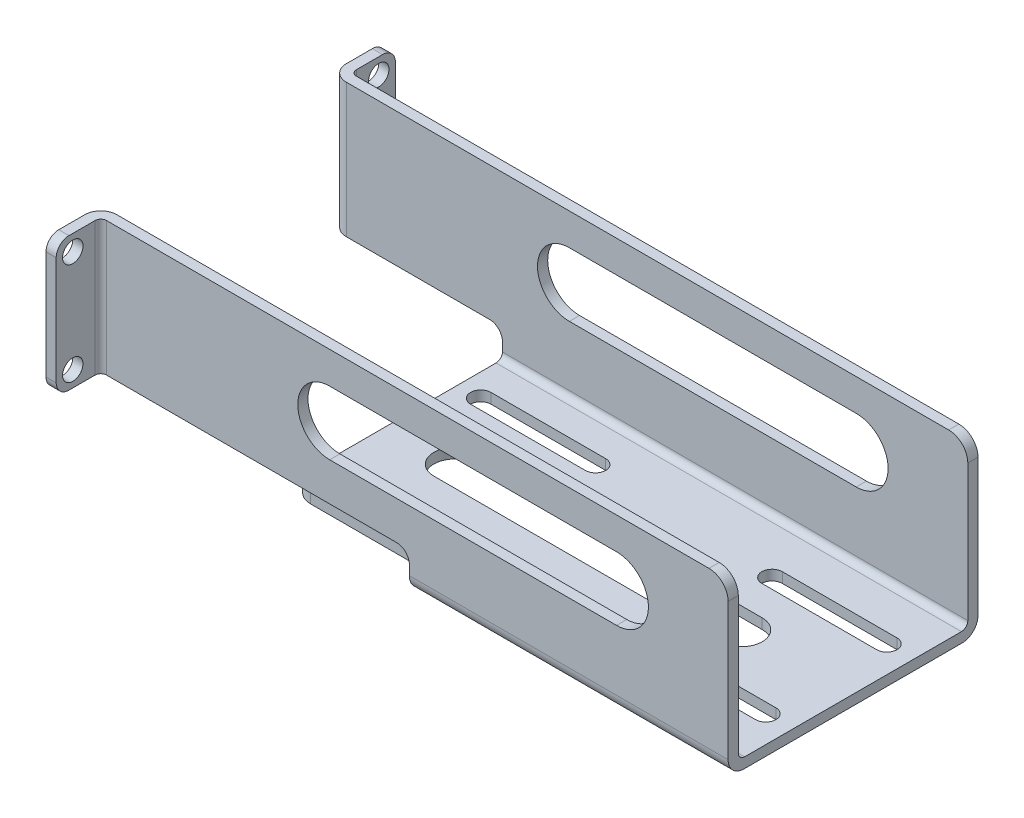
ISO-10303-21;
HEADER;
FILE_DESCRIPTION(('STEP AP214'),'2;1');
FILE_NAME('part.step','',(''),(''),'','','');
FILE_SCHEMA(('AUTOMOTIVE_DESIGN { 1 0 10303 214 1 1 1 1 }'));
ENDSEC;
DATA;
#1=APPLICATION_CONTEXT('core data for automotive mechanical design processes');
#2=APPLICATION_PROTOCOL_DEFINITION('international standard','automotive_design',2000,#1);
#3=PRODUCT_CONTEXT('',#1,'mechanical');
#4=PRODUCT('Part','Part','',(#3));
#5=PRODUCT_RELATED_PRODUCT_CATEGORY('part','',(#4));
#6=PRODUCT_DEFINITION_FORMATION('','',#4);
#7=PRODUCT_DEFINITION_CONTEXT('part definition',#1,'design');
#8=PRODUCT_DEFINITION('design','',#6,#7);
#9=PRODUCT_DEFINITION_SHAPE('','',#8);
#10=(LENGTH_UNIT() NAMED_UNIT(*) SI_UNIT(.MILLI.,.METRE.));
#11=(NAMED_UNIT(*) PLANE_ANGLE_UNIT() SI_UNIT($,.RADIAN.));
#12=(NAMED_UNIT(*) SI_UNIT($,.STERADIAN.) SOLID_ANGLE_UNIT());
#13=UNCERTAINTY_MEASURE_WITH_UNIT(LENGTH_MEASURE(1.E-05),#10,'distance_accuracy_value','');
#14=(GEOMETRIC_REPRESENTATION_CONTEXT(3) GLOBAL_UNCERTAINTY_ASSIGNED_CONTEXT((#13)) GLOBAL_UNIT_ASSIGNED_CONTEXT((#10,
#11,#12)) REPRESENTATION_CONTEXT('',''));
#15=CARTESIAN_POINT('',(0.,0.,0.));
#16=DIRECTION('',(0.,0.,1.));
#17=DIRECTION('',(1.,0.,0.));
#18=AXIS2_PLACEMENT_3D('',#15,#16,#17);
#19=CARTESIAN_POINT('',(-47.5,1.6,19.6));
#20=DIRECTION('',(0.,0.,-1.));
#21=DIRECTION('',(-1.,0.,0.));
#22=AXIS2_PLACEMENT_3D('',#19,#20,#21);
#23=PLANE('',#22);
#24=DIRECTION('',(1.,0.,0.));
#25=VECTOR('',#24,1.);
#26=CARTESIAN_POINT('',(-10.,12.,19.6));
#27=LINE('',#26,#25);
#28=CARTESIAN_POINT('',(-10.,12.,19.6));
#29=VERTEX_POINT('',#28);
#30=CARTESIAN_POINT('',(35.,12.,19.6));
#31=VERTEX_POINT('',#30);
#32=EDGE_CURVE('E580',#29,#31,#27,.T.);
#33=ORIENTED_EDGE('',*,*,#32,.F.);
#34=CARTESIAN_POINT('',(-10.,17.,19.6));
#35=DIRECTION('',(0.,0.,1.));
#36=DIRECTION('',(1.,0.,0.));
#37=AXIS2_PLACEMENT_3D('',#34,#35,#36);
#38=CIRCLE('',#37,5.);
#39=CARTESIAN_POINT('',(-10.,22.,19.6));
#40=VERTEX_POINT('',#39);
#41=EDGE_CURVE('E578',#40,#29,#38,.T.);
#42=ORIENTED_EDGE('',*,*,#41,.F.);
#43=DIRECTION('',(-1.,0.,0.));
#44=VECTOR('',#43,1.);
#45=CARTESIAN_POINT('',(-10.,22.,19.6));
#46=LINE('',#45,#44);
#47=CARTESIAN_POINT('',(35.,22.,19.6));
#48=VERTEX_POINT('',#47);
#49=EDGE_CURVE('E586',#48,#40,#46,.T.);
#50=ORIENTED_EDGE('',*,*,#49,.F.);
#51=CARTESIAN_POINT('',(35.,17.,19.6));
#52=DIRECTION('',(0.,0.,1.));
#53=DIRECTION('',(1.,0.,0.));
#54=AXIS2_PLACEMENT_3D('',#51,#52,#53);
#55=CIRCLE('',#54,5.);
#56=EDGE_CURVE('E583',#31,#48,#55,.T.);
#57=ORIENTED_EDGE('',*,*,#56,.F.);
#58=EDGE_LOOP('',(#33,#42,#50,#57));
#59=FACE_BOUND('',#58,.T.);
#60=DIRECTION('',(0.,-1.,0.));
#61=VECTOR('',#60,1.);
#62=CARTESIAN_POINT('',(52.5,40.5,19.6));
#63=LINE('',#62,#61);
#64=CARTESIAN_POINT('',(52.5,24.,19.6));
#65=VERTEX_POINT('',#64);
#66=CARTESIAN_POINT('',(52.5,2.5,19.6));
#67=VERTEX_POINT('',#66);
#68=EDGE_CURVE('E513',#65,#67,#63,.T.);
#69=ORIENTED_EDGE('',*,*,#68,.F.);
#70=CARTESIAN_POINT('',(49.5,24.,19.6));
#71=DIRECTION('',(0.,0.,-1.));
#72=DIRECTION('',(-1.,0.,0.));
#73=AXIS2_PLACEMENT_3D('',#70,#71,#72);
#74=CIRCLE('',#73,3.);
#75=CARTESIAN_POINT('',(49.5,27.,19.6));
#76=VERTEX_POINT('',#75);
#77=EDGE_CURVE('E37',#65,#76,#74,.F.);
#78=ORIENTED_EDGE('',*,*,#77,.T.);
#79=DIRECTION('',(1.,0.,0.));
#80=VECTOR('',#79,1.);
#81=CARTESIAN_POINT('',(-47.5,27.,19.6));
#82=LINE('',#81,#80);
#83=CARTESIAN_POINT('',(-45.,27.,19.6));
#84=VERTEX_POINT('',#83);
#85=EDGE_CURVE('E704',#84,#76,#82,.T.);
#86=ORIENTED_EDGE('',*,*,#85,.F.);
#87=DIRECTION('',(0.,-1.,0.));
#88=VECTOR('',#87,1.);
#89=CARTESIAN_POINT('',(-45.,1.6,19.6));
#90=LINE('',#89,#88);
#91=CARTESIAN_POINT('',(-45.,6.00000000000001,19.6));
#92=VERTEX_POINT('',#91);
#93=EDGE_CURVE('E803',#84,#92,#90,.T.);
#94=ORIENTED_EDGE('',*,*,#93,.T.);
#95=DIRECTION('',(-1.,0.,0.));
#96=VECTOR('',#95,1.);
#97=CARTESIAN_POINT('',(-20.5,6.00000000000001,19.6));
#98=LINE('',#97,#96);
#99=CARTESIAN_POINT('',(0.5,6.00000000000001,19.6));
#100=VERTEX_POINT('',#99);
#101=EDGE_CURVE('E650',#100,#92,#98,.T.);
#102=ORIENTED_EDGE('',*,*,#101,.F.);
#103=CARTESIAN_POINT('',(0.500000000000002,4.00000000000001,19.6));
#104=DIRECTION('',(0.,0.,-1.));
#105=DIRECTION('',(-1.,0.,0.));
#106=AXIS2_PLACEMENT_3D('',#103,#104,#105);
#107=CIRCLE('',#106,2.);
#108=CARTESIAN_POINT('',(2.5,4.00000000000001,19.6));
#109=VERTEX_POINT('',#108);
#110=EDGE_CURVE('E853',#100,#109,#107,.T.);
#111=ORIENTED_EDGE('',*,*,#110,.T.);
#112=DIRECTION('',(0.,1.,0.));
#113=VECTOR('',#112,1.);
#114=CARTESIAN_POINT('',(2.5,6.00000000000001,19.6));
#115=LINE('',#114,#113);
#116=CARTESIAN_POINT('',(2.5,2.5,19.6));
#117=VERTEX_POINT('',#116);
#118=EDGE_CURVE('E570',#117,#109,#115,.T.);
#119=ORIENTED_EDGE('',*,*,#118,.F.);
#120=DIRECTION('',(1.,0.,0.));
#121=VECTOR('',#120,1.);
#122=CARTESIAN_POINT('',(-47.5,2.5,19.6));
#123=LINE('',#122,#121);
#124=EDGE_CURVE('E737',#117,#67,#123,.T.);
#125=ORIENTED_EDGE('',*,*,#124,.T.);
#126=EDGE_LOOP('',(#69,#78,#86,#94,#102,#111,#119,#125));
#127=FACE_BOUND('',#126,.T.);
#128=ADVANCED_FACE('F15',(#59,#127),#23,.F.);
#129=CARTESIAN_POINT('',(-47.5,27.,-19.6));
#130=DIRECTION('',(0.,1.,0.));
#131=DIRECTION('',(0.,0.,1.));
#132=AXIS2_PLACEMENT_3D('',#129,#130,#131);
#133=PLANE('',#132);
#134=DIRECTION('',(1.,0.,0.));
#135=VECTOR('',#134,1.);
#136=CARTESIAN_POINT('',(-47.5,27.,-18.));
#137=LINE('',#136,#135);
#138=CARTESIAN_POINT('',(-45.,27.,-18.));
#139=VERTEX_POINT('',#138);
#140=CARTESIAN_POINT('',(49.5,27.,-18.));
#141=VERTEX_POINT('',#140);
#142=EDGE_CURVE('E713',#139,#141,#137,.T.);
#143=ORIENTED_EDGE('',*,*,#142,.T.);
#144=DIRECTION('',(0.,0.,1.));
#145=VECTOR('',#144,1.);
#146=CARTESIAN_POINT('',(49.5,27.,-19.6));
#147=LINE('',#146,#145);
#148=CARTESIAN_POINT('',(49.5,27.,-19.6));
#149=VERTEX_POINT('',#148);
#150=EDGE_CURVE('E1010',#141,#149,#147,.F.);
#151=ORIENTED_EDGE('',*,*,#150,.T.);
#152=DIRECTION('',(-1.,0.,0.));
#153=VECTOR('',#152,1.);
#154=CARTESIAN_POINT('',(-47.5,27.,-19.6));
#155=LINE('',#154,#153);
#156=CARTESIAN_POINT('',(-45.,27.,-19.6));
#157=VERTEX_POINT('',#156);
#158=EDGE_CURVE('E716',#149,#157,#155,.T.);
#159=ORIENTED_EDGE('',*,*,#158,.T.);
#160=CARTESIAN_POINT('',(-45.,27.,-20.5));
#161=DIRECTION('',(0.,1.,0.));
#162=DIRECTION('',(0.,0.,1.));
#163=AXIS2_PLACEMENT_3D('',#160,#161,#162);
#164=CIRCLE('',#163,0.9);
#165=CARTESIAN_POINT('',(-45.9,27.,-20.5));
#166=VERTEX_POINT('',#165);
#167=EDGE_CURVE('E811',#157,#166,#164,.F.);
#168=ORIENTED_EDGE('',*,*,#167,.T.);
#169=DIRECTION('',(0.,0.,1.));
#170=VECTOR('',#169,1.);
#171=CARTESIAN_POINT('',(-45.9,27.,-26.6));
#172=LINE('',#171,#170);
#173=CARTESIAN_POINT('',(-45.9,27.,-24.6));
#174=VERTEX_POINT('',#173);
#175=EDGE_CURVE('E701',#174,#166,#172,.T.);
#176=ORIENTED_EDGE('',*,*,#175,.F.);
#177=DIRECTION('',(1.,0.,0.));
#178=VECTOR('',#177,1.);
#179=CARTESIAN_POINT('',(-47.5,27.,-24.6));
#180=LINE('',#179,#178);
#181=CARTESIAN_POINT('',(-47.5,27.,-24.6));
#182=VERTEX_POINT('',#181);
#183=EDGE_CURVE('E756',#174,#182,#180,.F.);
#184=ORIENTED_EDGE('',*,*,#183,.T.);
#185=DIRECTION('',(0.,0.,1.));
#186=VECTOR('',#185,1.);
#187=CARTESIAN_POINT('',(-47.5,27.,-19.6));
#188=LINE('',#187,#186);
#189=CARTESIAN_POINT('',(-47.5,27.,-20.5));
#190=VERTEX_POINT('',#189);
#191=EDGE_CURVE('E710',#182,#190,#188,.T.);
#192=ORIENTED_EDGE('',*,*,#191,.T.);
#193=CARTESIAN_POINT('',(-45.,27.,-20.5));
#194=DIRECTION('',(0.,1.,0.));
#195=DIRECTION('',(0.,0.,1.));
#196=AXIS2_PLACEMENT_3D('',#193,#194,#195);
#197=CIRCLE('',#196,2.5);
#198=EDGE_CURVE('E784',#190,#139,#197,.T.);
#199=ORIENTED_EDGE('',*,*,#198,.T.);
#200=EDGE_LOOP('',(#143,#151,#159,#168,#176,#184,#192,#199));
#201=FACE_BOUND('',#200,.T.);
#202=ADVANCED_FACE('F899',(#201),#133,.T.);
#203=CARTESIAN_POINT('',(47.5,27.,19.6));
#204=DIRECTION('',(0.,1.,0.));
#205=DIRECTION('',(0.,0.,1.));
#206=AXIS2_PLACEMENT_3D('',#203,#204,#205);
#207=PLANE('',#206);
#208=ORIENTED_EDGE('',*,*,#85,.T.);
#209=DIRECTION('',(0.,0.,1.));
#210=VECTOR('',#209,1.);
#211=CARTESIAN_POINT('',(49.5,27.,19.6));
#212=LINE('',#211,#210);
#213=CARTESIAN_POINT('',(49.5,27.,18.));
#214=VERTEX_POINT('',#213);
#215=EDGE_CURVE('E23',#76,#214,#212,.F.);
#216=ORIENTED_EDGE('',*,*,#215,.T.);
#217=DIRECTION('',(-1.,0.,0.));
#218=VECTOR('',#217,1.);
#219=CARTESIAN_POINT('',(-47.5,27.,18.));
#220=LINE('',#219,#218);
#221=CARTESIAN_POINT('',(-45.,27.,18.));
#222=VERTEX_POINT('',#221);
#223=EDGE_CURVE('E706',#214,#222,#220,.T.);
#224=ORIENTED_EDGE('',*,*,#223,.T.);
#225=CARTESIAN_POINT('',(-45.,27.,20.5));
#226=DIRECTION('',(0.,1.,0.));
#227=DIRECTION('',(0.,0.,1.));
#228=AXIS2_PLACEMENT_3D('',#225,#226,#227);
#229=CIRCLE('',#228,2.5);
#230=CARTESIAN_POINT('',(-47.5,27.,20.5));
#231=VERTEX_POINT('',#230);
#232=EDGE_CURVE('E795',#222,#231,#229,.T.);
#233=ORIENTED_EDGE('',*,*,#232,.T.);
#234=DIRECTION('',(0.,0.,1.));
#235=VECTOR('',#234,1.);
#236=CARTESIAN_POINT('',(-47.5,27.,19.6));
#237=LINE('',#236,#235);
#238=CARTESIAN_POINT('',(-47.5,27.,24.6));
#239=VERTEX_POINT('',#238);
#240=EDGE_CURVE('E708',#231,#239,#237,.T.);
#241=ORIENTED_EDGE('',*,*,#240,.T.);
#242=DIRECTION('',(1.,0.,0.));
#243=VECTOR('',#242,1.);
#244=CARTESIAN_POINT('',(-45.9,27.,24.6));
#245=LINE('',#244,#243);
#246=CARTESIAN_POINT('',(-45.9,27.,24.6));
#247=VERTEX_POINT('',#246);
#248=EDGE_CURVE('E774',#239,#247,#245,.T.);
#249=ORIENTED_EDGE('',*,*,#248,.T.);
#250=DIRECTION('',(0.,0.,-1.));
#251=VECTOR('',#250,1.);
#252=CARTESIAN_POINT('',(-45.9,27.,26.6));
#253=LINE('',#252,#251);
#254=CARTESIAN_POINT('',(-45.9,27.,20.5));
#255=VERTEX_POINT('',#254);
#256=EDGE_CURVE('E680',#247,#255,#253,.T.);
#257=ORIENTED_EDGE('',*,*,#256,.T.);
#258=CARTESIAN_POINT('',(-45.,27.,20.5));
#259=DIRECTION('',(0.,1.,0.));
#260=DIRECTION('',(0.,0.,1.));
#261=AXIS2_PLACEMENT_3D('',#258,#259,#260);
#262=CIRCLE('',#261,0.9);
#263=EDGE_CURVE('E815',#255,#84,#262,.F.);
#264=ORIENTED_EDGE('',*,*,#263,.T.);
#265=EDGE_LOOP('',(#208,#216,#224,#233,#241,#249,#257,#264));
#266=FACE_BOUND('',#265,.T.);
#267=ADVANCED_FACE('F907',(#266),#207,.T.);
#268=CARTESIAN_POINT('',(-47.5,1.6,-19.6));
#269=DIRECTION('',(1.,0.,0.));
#270=DIRECTION('',(0.,0.,-1.));
#271=AXIS2_PLACEMENT_3D('',#268,#269,#270);
#272=PLANE('',#271);
#273=CARTESIAN_POINT('',(-47.5,24.5,-24.));
#274=DIRECTION('',(1.,0.,0.));
#275=DIRECTION('',(0.,0.,-1.));
#276=AXIS2_PLACEMENT_3D('',#273,#274,#275);
#277=CIRCLE('',#276,1.6);
#278=CARTESIAN_POINT('',(-47.5,24.5,-25.6));
#279=VERTEX_POINT('',#278);
#280=EDGE_CURVE('E629',#279,#279,#277,.F.);
#281=ORIENTED_EDGE('',*,*,#280,.F.);
#282=EDGE_LOOP('',(#281));
#283=FACE_BOUND('',#282,.T.);
#284=CARTESIAN_POINT('',(-47.5,8.49999999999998,-24.));
#285=DIRECTION('',(1.,0.,0.));
#286=DIRECTION('',(0.,0.,-1.));
#287=AXIS2_PLACEMENT_3D('',#284,#285,#286);
#288=CIRCLE('',#287,1.6);
#289=CARTESIAN_POINT('',(-47.5,8.49999999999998,-25.6));
#290=VERTEX_POINT('',#289);
#291=EDGE_CURVE('E635',#290,#290,#288,.F.);
#292=ORIENTED_EDGE('',*,*,#291,.F.);
#293=EDGE_LOOP('',(#292));
#294=FACE_BOUND('',#293,.T.);
#295=DIRECTION('',(0.,0.,1.));
#296=VECTOR('',#295,1.);
#297=CARTESIAN_POINT('',(-47.5,6.00000000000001,-26.6));
#298=LINE('',#297,#296);
#299=CARTESIAN_POINT('',(-47.5,6.00000000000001,-24.6));
#300=VERTEX_POINT('',#299);
#301=CARTESIAN_POINT('',(-47.5,6.00000000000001,-20.5));
#302=VERTEX_POINT('',#301);
#303=EDGE_CURVE('E695',#300,#302,#298,.T.);
#304=ORIENTED_EDGE('',*,*,#303,.T.);
#305=DIRECTION('',(0.,-1.,0.));
#306=VECTOR('',#305,1.);
#307=CARTESIAN_POINT('',(-47.5,1.6,-20.5));
#308=LINE('',#307,#306);
#309=EDGE_CURVE('E782',#302,#190,#308,.F.);
#310=ORIENTED_EDGE('',*,*,#309,.T.);
#311=ORIENTED_EDGE('',*,*,#191,.F.);
#312=CARTESIAN_POINT('',(-47.5,25.,-24.6));
#313=DIRECTION('',(1.,0.,0.));
#314=DIRECTION('',(0.,0.,-1.));
#315=AXIS2_PLACEMENT_3D('',#312,#313,#314);
#316=CIRCLE('',#315,2.);
#317=CARTESIAN_POINT('',(-47.5,25.,-26.6));
#318=VERTEX_POINT('',#317);
#319=EDGE_CURVE('E746',#182,#318,#316,.F.);
#320=ORIENTED_EDGE('',*,*,#319,.T.);
#321=DIRECTION('',(0.,1.,0.));
#322=VECTOR('',#321,1.);
#323=CARTESIAN_POINT('',(-47.5,27.,-26.6));
#324=LINE('',#323,#322);
#325=CARTESIAN_POINT('',(-47.5,8.00000000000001,-26.6));
#326=VERTEX_POINT('',#325);
#327=EDGE_CURVE('E689',#326,#318,#324,.T.);
#328=ORIENTED_EDGE('',*,*,#327,.F.);
#329=CARTESIAN_POINT('',(-47.5,8.00000000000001,-24.6));
#330=DIRECTION('',(1.,0.,0.));
#331=DIRECTION('',(0.,0.,-1.));
#332=AXIS2_PLACEMENT_3D('',#329,#330,#331);
#333=CIRCLE('',#332,2.);
#334=EDGE_CURVE('E748',#326,#300,#333,.F.);
#335=ORIENTED_EDGE('',*,*,#334,.T.);
#336=EDGE_LOOP('',(#304,#310,#311,#320,#328,#335));
#337=FACE_BOUND('',#336,.T.);
#338=ADVANCED_FACE('F919',(#283,#294,#337),#272,.F.);
#339=CARTESIAN_POINT('',(-47.5,1.6,-19.6));
#340=DIRECTION('',(0.,0.,1.));
#341=DIRECTION('',(1.,0.,0.));
#342=AXIS2_PLACEMENT_3D('',#339,#340,#341);
#343=PLANE('',#342);
#344=DIRECTION('',(-1.,0.,0.));
#345=VECTOR('',#344,1.);
#346=CARTESIAN_POINT('',(-47.5,22.,-19.6));
#347=LINE('',#346,#345);
#348=CARTESIAN_POINT('',(35.,22.,-19.6));
#349=VERTEX_POINT('',#348);
#350=CARTESIAN_POINT('',(-10.,22.,-19.6));
#351=VERTEX_POINT('',#350);
#352=EDGE_CURVE('E617',#349,#351,#347,.T.);
#353=ORIENTED_EDGE('',*,*,#352,.T.);
#354=CARTESIAN_POINT('',(-10.,17.,-19.6));
#355=DIRECTION('',(0.,0.,1.));
#356=DIRECTION('',(1.,0.,0.));
#357=AXIS2_PLACEMENT_3D('',#354,#355,#356);
#358=CIRCLE('',#357,5.);
#359=CARTESIAN_POINT('',(-10.,12.,-19.6));
#360=VERTEX_POINT('',#359);
#361=EDGE_CURVE('E623',#351,#360,#358,.T.);
#362=ORIENTED_EDGE('',*,*,#361,.T.);
#363=DIRECTION('',(1.,0.,0.));
#364=VECTOR('',#363,1.);
#365=CARTESIAN_POINT('',(-47.5,12.,-19.6));
#366=LINE('',#365,#364);
#367=CARTESIAN_POINT('',(35.,12.,-19.6));
#368=VERTEX_POINT('',#367);
#369=EDGE_CURVE('E605',#360,#368,#366,.T.);
#370=ORIENTED_EDGE('',*,*,#369,.T.);
#371=CARTESIAN_POINT('',(35.,17.,-19.6));
#372=DIRECTION('',(0.,0.,1.));
#373=DIRECTION('',(1.,0.,0.));
#374=AXIS2_PLACEMENT_3D('',#371,#372,#373);
#375=CIRCLE('',#374,5.);
#376=EDGE_CURVE('E611',#368,#349,#375,.T.);
#377=ORIENTED_EDGE('',*,*,#376,.T.);
#378=EDGE_LOOP('',(#353,#362,#370,#377));
#379=FACE_BOUND('',#378,.T.);
#380=ORIENTED_EDGE('',*,*,#158,.F.);
#381=CARTESIAN_POINT('',(49.5,24.,-19.6));
#382=DIRECTION('',(0.,0.,1.));
#383=DIRECTION('',(1.,0.,0.));
#384=AXIS2_PLACEMENT_3D('',#381,#382,#383);
#385=CIRCLE('',#384,3.);
#386=CARTESIAN_POINT('',(52.5,24.,-19.6));
#387=VERTEX_POINT('',#386);
#388=EDGE_CURVE('E1012',#149,#387,#385,.F.);
#389=ORIENTED_EDGE('',*,*,#388,.T.);
#390=DIRECTION('',(0.,1.,0.));
#391=VECTOR('',#390,1.);
#392=CARTESIAN_POINT('',(52.5,2.5,-19.6));
#393=LINE('',#392,#391);
#394=CARTESIAN_POINT('',(52.5,2.5,-19.6));
#395=VERTEX_POINT('',#394);
#396=EDGE_CURVE('E524',#395,#387,#393,.T.);
#397=ORIENTED_EDGE('',*,*,#396,.F.);
#398=DIRECTION('',(-1.,0.,0.));
#399=VECTOR('',#398,1.);
#400=CARTESIAN_POINT('',(-47.5,2.5,-19.6));
#401=LINE('',#400,#399);
#402=CARTESIAN_POINT('',(-20.5,2.5,-19.6));
#403=VERTEX_POINT('',#402);
#404=EDGE_CURVE('E729',#395,#403,#401,.T.);
#405=ORIENTED_EDGE('',*,*,#404,.T.);
#406=DIRECTION('',(0.,1.,0.));
#407=VECTOR('',#406,1.);
#408=CARTESIAN_POINT('',(-20.5,1.6,-19.6));
#409=LINE('',#408,#407);
#410=CARTESIAN_POINT('',(-20.5,4.00000000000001,-19.6));
#411=VERTEX_POINT('',#410);
#412=EDGE_CURVE('E657',#403,#411,#409,.T.);
#413=ORIENTED_EDGE('',*,*,#412,.T.);
#414=CARTESIAN_POINT('',(-22.5,4.00000000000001,-19.6));
#415=DIRECTION('',(0.,0.,1.));
#416=DIRECTION('',(1.,0.,0.));
#417=AXIS2_PLACEMENT_3D('',#414,#415,#416);
#418=CIRCLE('',#417,2.);
#419=CARTESIAN_POINT('',(-22.5,6.00000000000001,-19.6));
#420=VERTEX_POINT('',#419);
#421=EDGE_CURVE('E824',#411,#420,#418,.T.);
#422=ORIENTED_EDGE('',*,*,#421,.T.);
#423=DIRECTION('',(-1.,0.,0.));
#424=VECTOR('',#423,1.);
#425=CARTESIAN_POINT('',(-47.5,6.00000000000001,-19.6));
#426=LINE('',#425,#424);
#427=CARTESIAN_POINT('',(-45.,6.00000000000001,-19.6));
#428=VERTEX_POINT('',#427);
#429=EDGE_CURVE('E661',#420,#428,#426,.T.);
#430=ORIENTED_EDGE('',*,*,#429,.T.);
#431=DIRECTION('',(0.,-1.,0.));
#432=VECTOR('',#431,1.);
#433=CARTESIAN_POINT('',(-45.,27.,-19.6));
#434=LINE('',#433,#432);
#435=EDGE_CURVE('E800',#428,#157,#434,.F.);
#436=ORIENTED_EDGE('',*,*,#435,.T.);
#437=EDGE_LOOP('',(#380,#389,#397,#405,#413,#422,#430,#436));
#438=FACE_BOUND('',#437,.T.);
#439=ADVANCED_FACE('F913',(#379,#438),#343,.F.);
#440=CARTESIAN_POINT('',(-47.5,1.6,19.6));
#441=DIRECTION('',(0.,1.,0.));
#442=DIRECTION('',(0.,0.,1.));
#443=AXIS2_PLACEMENT_3D('',#440,#441,#442);
#444=PLANE('',#443);
#445=CARTESIAN_POINT('',(48.3,1.6,9.5));
#446=DIRECTION('',(0.,1.,0.));
#447=DIRECTION('',(0.,0.,-1.));
#448=AXIS2_PLACEMENT_3D('',#445,#446,#447);
#449=CIRCLE('',#448,1.6);
#450=CARTESIAN_POINT('',(48.3,1.6,11.1));
#451=VERTEX_POINT('',#450);
#452=CARTESIAN_POINT('',(48.3,1.6,7.9));
#453=VERTEX_POINT('',#452);
#454=EDGE_CURVE('E433',#451,#453,#449,.T.);
#455=ORIENTED_EDGE('',*,*,#454,.F.);
#456=DIRECTION('',(1.,0.,0.));
#457=VECTOR('',#456,1.);
#458=CARTESIAN_POINT('',(30.3,1.6,11.1));
#459=LINE('',#458,#457);
#460=CARTESIAN_POINT('',(30.3,1.6,11.1));
#461=VERTEX_POINT('',#460);
#462=EDGE_CURVE('E438',#461,#451,#459,.T.);
#463=ORIENTED_EDGE('',*,*,#462,.F.);
#464=CARTESIAN_POINT('',(30.3,1.6,9.5));
#465=DIRECTION('',(0.,1.,0.));
#466=DIRECTION('',(0.,0.,-1.));
#467=AXIS2_PLACEMENT_3D('',#464,#465,#466);
#468=CIRCLE('',#467,1.6);
#469=CARTESIAN_POINT('',(30.3,1.6,7.9));
#470=VERTEX_POINT('',#469);
#471=EDGE_CURVE('E417',#470,#461,#468,.T.);
#472=ORIENTED_EDGE('',*,*,#471,.F.);
#473=DIRECTION('',(-1.,0.,0.));
#474=VECTOR('',#473,1.);
#475=CARTESIAN_POINT('',(30.3,1.6,7.9));
#476=LINE('',#475,#474);
#477=EDGE_CURVE('E428',#453,#470,#476,.T.);
#478=ORIENTED_EDGE('',*,*,#477,.F.);
#479=EDGE_LOOP('',(#455,#463,#472,#478));
#480=FACE_BOUND('',#479,.T.);
#481=CARTESIAN_POINT('',(30.3,1.6,-9.5));
#482=DIRECTION('',(0.,1.,0.));
#483=DIRECTION('',(0.,0.,1.));
#484=AXIS2_PLACEMENT_3D('',#481,#482,#483);
#485=CIRCLE('',#484,1.6);
#486=CARTESIAN_POINT('',(30.3,1.6,-11.1));
#487=VERTEX_POINT('',#486);
#488=CARTESIAN_POINT('',(30.3,1.6,-7.9));
#489=VERTEX_POINT('',#488);
#490=EDGE_CURVE('E445',#487,#489,#485,.T.);
#491=ORIENTED_EDGE('',*,*,#490,.F.);
#492=DIRECTION('',(-1.,0.,0.));
#493=VECTOR('',#492,1.);
#494=CARTESIAN_POINT('',(30.3,1.6,-11.1));
#495=LINE('',#494,#493);
#496=CARTESIAN_POINT('',(48.3,1.6,-11.1));
#497=VERTEX_POINT('',#496);
#498=EDGE_CURVE('E455',#497,#487,#495,.T.);
#499=ORIENTED_EDGE('',*,*,#498,.F.);
#500=CARTESIAN_POINT('',(48.3,1.6,-9.5));
#501=DIRECTION('',(0.,1.,0.));
#502=DIRECTION('',(0.,0.,1.));
#503=AXIS2_PLACEMENT_3D('',#500,#501,#502);
#504=CIRCLE('',#503,1.6);
#505=CARTESIAN_POINT('',(48.3,1.6,-7.9));
#506=VERTEX_POINT('',#505);
#507=EDGE_CURVE('E452',#506,#497,#504,.T.);
#508=ORIENTED_EDGE('',*,*,#507,.F.);
#509=DIRECTION('',(1.,0.,0.));
#510=VECTOR('',#509,1.);
#511=CARTESIAN_POINT('',(30.3,1.6,-7.9));
#512=LINE('',#511,#510);
#513=EDGE_CURVE('E449',#489,#506,#512,.T.);
#514=ORIENTED_EDGE('',*,*,#513,.F.);
#515=EDGE_LOOP('',(#491,#499,#508,#514));
#516=FACE_BOUND('',#515,.T.);
#517=CARTESIAN_POINT('',(1.1,1.6,11.));
#518=DIRECTION('',(0.,1.,0.));
#519=DIRECTION('',(0.,0.,-1.));
#520=AXIS2_PLACEMENT_3D('',#517,#518,#519);
#521=CIRCLE('',#520,1.6);
#522=CARTESIAN_POINT('',(1.1,1.6,12.6));
#523=VERTEX_POINT('',#522);
#524=CARTESIAN_POINT('',(1.1,1.6,9.4));
#525=VERTEX_POINT('',#524);
#526=EDGE_CURVE('E461',#523,#525,#521,.T.);
#527=ORIENTED_EDGE('',*,*,#526,.F.);
#528=DIRECTION('',(1.,0.,0.));
#529=VECTOR('',#528,1.);
#530=CARTESIAN_POINT('',(-16.9,1.6,12.6));
#531=LINE('',#530,#529);
#532=CARTESIAN_POINT('',(-16.9,1.6,12.6));
#533=VERTEX_POINT('',#532);
#534=EDGE_CURVE('E475',#533,#523,#531,.T.);
#535=ORIENTED_EDGE('',*,*,#534,.F.);
#536=CARTESIAN_POINT('',(-16.9,1.6,11.));
#537=DIRECTION('',(0.,1.,0.));
#538=DIRECTION('',(0.,0.,-1.));
#539=AXIS2_PLACEMENT_3D('',#536,#537,#538);
#540=CIRCLE('',#539,1.6);
#541=CARTESIAN_POINT('',(-16.9,1.6,9.4));
#542=VERTEX_POINT('',#541);
#543=EDGE_CURVE('E472',#542,#533,#540,.T.);
#544=ORIENTED_EDGE('',*,*,#543,.F.);
#545=DIRECTION('',(-1.,0.,0.));
#546=VECTOR('',#545,1.);
#547=CARTESIAN_POINT('',(-16.9,1.6,9.4));
#548=LINE('',#547,#546);
#549=EDGE_CURVE('E469',#525,#542,#548,.T.);
#550=ORIENTED_EDGE('',*,*,#549,.F.);
#551=EDGE_LOOP('',(#527,#535,#544,#550));
#552=FACE_BOUND('',#551,.T.);
#553=CARTESIAN_POINT('',(-16.9,1.6,-11.));
#554=DIRECTION('',(0.,1.,0.));
#555=DIRECTION('',(0.,0.,1.));
#556=AXIS2_PLACEMENT_3D('',#553,#554,#555);
#557=CIRCLE('',#556,1.6);
#558=CARTESIAN_POINT('',(-16.9,1.6,-12.6));
#559=VERTEX_POINT('',#558);
#560=CARTESIAN_POINT('',(-16.9,1.6,-9.4));
#561=VERTEX_POINT('',#560);
#562=EDGE_CURVE('E481',#559,#561,#557,.T.);
#563=ORIENTED_EDGE('',*,*,#562,.F.);
#564=DIRECTION('',(-1.,0.,0.));
#565=VECTOR('',#564,1.);
#566=CARTESIAN_POINT('',(-16.9,1.6,-12.6));
#567=LINE('',#566,#565);
#568=CARTESIAN_POINT('',(1.1,1.6,-12.6));
#569=VERTEX_POINT('',#568);
#570=EDGE_CURVE('E495',#569,#559,#567,.T.);
#571=ORIENTED_EDGE('',*,*,#570,.F.);
#572=CARTESIAN_POINT('',(1.1,1.6,-11.));
#573=DIRECTION('',(0.,1.,0.));
#574=DIRECTION('',(0.,0.,1.));
#575=AXIS2_PLACEMENT_3D('',#572,#573,#574);
#576=CIRCLE('',#575,1.6);
#577=CARTESIAN_POINT('',(1.1,1.6,-9.4));
#578=VERTEX_POINT('',#577);
#579=EDGE_CURVE('E492',#578,#569,#576,.T.);
#580=ORIENTED_EDGE('',*,*,#579,.F.);
#581=DIRECTION('',(1.,0.,0.));
#582=VECTOR('',#581,1.);
#583=CARTESIAN_POINT('',(-16.9,1.6,-9.4));
#584=LINE('',#583,#582);
#585=EDGE_CURVE('E489',#561,#578,#584,.T.);
#586=ORIENTED_EDGE('',*,*,#585,.F.);
#587=EDGE_LOOP('',(#563,#571,#580,#586));
#588=FACE_BOUND('',#587,.T.);
#589=CARTESIAN_POINT('',(-10.,1.6,0.));
#590=DIRECTION('',(0.,1.,0.));
#591=DIRECTION('',(0.,0.,1.));
#592=AXIS2_PLACEMENT_3D('',#589,#590,#591);
#593=CIRCLE('',#592,3.25);
#594=CARTESIAN_POINT('',(-10.,1.6,-3.25));
#595=VERTEX_POINT('',#594);
#596=CARTESIAN_POINT('',(-9.99999999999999,1.6,3.25));
#597=VERTEX_POINT('',#596);
#598=EDGE_CURVE('E543',#595,#597,#593,.T.);
#599=ORIENTED_EDGE('',*,*,#598,.F.);
#600=DIRECTION('',(-1.,0.,0.));
#601=VECTOR('',#600,1.);
#602=CARTESIAN_POINT('',(-10.,1.6,-3.25));
#603=LINE('',#602,#601);
#604=CARTESIAN_POINT('',(35.,1.6,-3.25));
#605=VERTEX_POINT('',#604);
#606=EDGE_CURVE('E551',#605,#595,#603,.T.);
#607=ORIENTED_EDGE('',*,*,#606,.F.);
#608=CARTESIAN_POINT('',(35.,1.6,0.));
#609=DIRECTION('',(0.,1.,0.));
#610=DIRECTION('',(0.,0.,1.));
#611=AXIS2_PLACEMENT_3D('',#608,#609,#610);
#612=CIRCLE('',#611,3.25);
#613=CARTESIAN_POINT('',(35.,1.6,3.25));
#614=VERTEX_POINT('',#613);
#615=EDGE_CURVE('E548',#614,#605,#612,.T.);
#616=ORIENTED_EDGE('',*,*,#615,.F.);
#617=DIRECTION('',(1.,0.,0.));
#618=VECTOR('',#617,1.);
#619=CARTESIAN_POINT('',(-10.,1.6,3.25));
#620=LINE('',#619,#618);
#621=EDGE_CURVE('E545',#597,#614,#620,.T.);
#622=ORIENTED_EDGE('',*,*,#621,.F.);
#623=EDGE_LOOP('',(#599,#607,#616,#622));
#624=FACE_BOUND('',#623,.T.);
#625=DIRECTION('',(0.,0.,-1.));
#626=VECTOR('',#625,1.);
#627=CARTESIAN_POINT('',(-20.5,1.6,-18.));
#628=LINE('',#627,#626);
#629=CARTESIAN_POINT('',(-20.5,1.6,12.1));
#630=VERTEX_POINT('',#629);
#631=CARTESIAN_POINT('',(-20.5,1.6,-17.));
#632=VERTEX_POINT('',#631);
#633=EDGE_CURVE('E663',#630,#632,#628,.T.);
#634=ORIENTED_EDGE('',*,*,#633,.F.);
#635=CARTESIAN_POINT('',(-17.5,1.6,12.1));
#636=DIRECTION('',(0.,1.,0.));
#637=DIRECTION('',(0.,0.,1.));
#638=AXIS2_PLACEMENT_3D('',#635,#636,#637);
#639=CIRCLE('',#638,3.);
#640=CARTESIAN_POINT('',(-17.5,1.6,15.1));
#641=VERTEX_POINT('',#640);
#642=EDGE_CURVE('E948',#630,#641,#639,.T.);
#643=ORIENTED_EDGE('',*,*,#642,.T.);
#644=DIRECTION('',(1.,0.,0.));
#645=VECTOR('',#644,1.);
#646=CARTESIAN_POINT('',(2.5,1.6,15.1));
#647=LINE('',#646,#645);
#648=CARTESIAN_POINT('',(0.500000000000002,1.6,15.1));
#649=VERTEX_POINT('',#648);
#650=EDGE_CURVE('E566',#641,#649,#647,.T.);
#651=ORIENTED_EDGE('',*,*,#650,.T.);
#652=CARTESIAN_POINT('',(0.500000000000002,1.6,17.1));
#653=DIRECTION('',(0.,1.,0.));
#654=DIRECTION('',(0.,0.,1.));
#655=AXIS2_PLACEMENT_3D('',#652,#653,#654);
#656=CIRCLE('',#655,2.);
#657=CARTESIAN_POINT('',(2.49749843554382,1.6,17.));
#658=VERTEX_POINT('',#657);
#659=EDGE_CURVE('E858',#649,#658,#656,.F.);
#660=ORIENTED_EDGE('',*,*,#659,.T.);
#661=DIRECTION('',(-1.,0.,0.));
#662=VECTOR('',#661,1.);
#663=CARTESIAN_POINT('',(-47.5,1.6,17.));
#664=LINE('',#663,#662);
#665=CARTESIAN_POINT('',(52.5,1.6,17.));
#666=VERTEX_POINT('',#665);
#667=EDGE_CURVE('E721',#658,#666,#664,.F.);
#668=ORIENTED_EDGE('',*,*,#667,.T.);
#669=DIRECTION('',(0.,0.,1.));
#670=VECTOR('',#669,1.);
#671=CARTESIAN_POINT('',(52.5,1.6,-17.));
#672=LINE('',#671,#670);
#673=CARTESIAN_POINT('',(52.5,1.6,-17.));
#674=VERTEX_POINT('',#673);
#675=EDGE_CURVE('E532',#674,#666,#672,.T.);
#676=ORIENTED_EDGE('',*,*,#675,.F.);
#677=DIRECTION('',(1.,0.,0.));
#678=VECTOR('',#677,1.);
#679=CARTESIAN_POINT('',(-47.5,1.6,-17.));
#680=LINE('',#679,#678);
#681=EDGE_CURVE('E723',#674,#632,#680,.F.);
#682=ORIENTED_EDGE('',*,*,#681,.T.);
#683=EDGE_LOOP('',(#634,#643,#651,#660,#668,#676,#682));
#684=FACE_BOUND('',#683,.T.);
#685=ADVANCED_FACE('F435',(#480,#516,#552,#588,#624,#684),#444,.T.);
#686=CARTESIAN_POINT('',(-47.5,8.49999999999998,24.));
#687=DIRECTION('',(1.,0.,0.));
#688=DIRECTION('',(0.,0.,-1.));
#689=AXIS2_PLACEMENT_3D('',#686,#687,#688);
#690=CIRCLE('',#689,1.6);
#691=CARTESIAN_POINT('',(-47.5,8.49999999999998,22.4));
#692=VERTEX_POINT('',#691);
#693=EDGE_CURVE('E641',#692,#692,#690,.F.);
#694=ORIENTED_EDGE('',*,*,#693,.F.);
#695=EDGE_LOOP('',(#694));
#696=FACE_BOUND('',#695,.T.);
#697=CARTESIAN_POINT('',(-47.5,24.5,24.));
#698=DIRECTION('',(1.,0.,0.));
#699=DIRECTION('',(0.,0.,-1.));
#700=AXIS2_PLACEMENT_3D('',#697,#698,#699);
#701=CIRCLE('',#700,1.6);
#702=CARTESIAN_POINT('',(-47.5,24.5,22.4));
#703=VERTEX_POINT('',#702);
#704=EDGE_CURVE('E647',#703,#703,#701,.F.);
#705=ORIENTED_EDGE('',*,*,#704,.F.);
#706=EDGE_LOOP('',(#705));
#707=FACE_BOUND('',#706,.T.);
#708=ORIENTED_EDGE('',*,*,#240,.F.);
#709=DIRECTION('',(0.,-1.,0.));
#710=VECTOR('',#709,1.);
#711=CARTESIAN_POINT('',(-47.5,1.6,20.5));
#712=LINE('',#711,#710);
#713=CARTESIAN_POINT('',(-47.5,6.00000000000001,20.5));
#714=VERTEX_POINT('',#713);
#715=EDGE_CURVE('E786',#231,#714,#712,.T.);
#716=ORIENTED_EDGE('',*,*,#715,.T.);
#717=DIRECTION('',(0.,0.,-1.));
#718=VECTOR('',#717,1.);
#719=CARTESIAN_POINT('',(-47.5,6.00000000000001,26.6));
#720=LINE('',#719,#718);
#721=CARTESIAN_POINT('',(-47.5,6.00000000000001,24.6));
#722=VERTEX_POINT('',#721);
#723=EDGE_CURVE('E686',#722,#714,#720,.T.);
#724=ORIENTED_EDGE('',*,*,#723,.F.);
#725=CARTESIAN_POINT('',(-47.5,8.00000000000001,24.6));
#726=DIRECTION('',(1.,0.,0.));
#727=DIRECTION('',(0.,0.,-1.));
#728=AXIS2_PLACEMENT_3D('',#725,#726,#727);
#729=CIRCLE('',#728,2.);
#730=CARTESIAN_POINT('',(-47.5,8.00000000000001,26.6));
#731=VERTEX_POINT('',#730);
#732=EDGE_CURVE('E764',#722,#731,#729,.F.);
#733=ORIENTED_EDGE('',*,*,#732,.T.);
#734=DIRECTION('',(0.,1.,0.));
#735=VECTOR('',#734,1.);
#736=CARTESIAN_POINT('',(-47.5,27.,26.6));
#737=LINE('',#736,#735);
#738=CARTESIAN_POINT('',(-47.5,25.,26.6));
#739=VERTEX_POINT('',#738);
#740=EDGE_CURVE('E674',#731,#739,#737,.T.);
#741=ORIENTED_EDGE('',*,*,#740,.T.);
#742=CARTESIAN_POINT('',(-47.5,25.,24.6));
#743=DIRECTION('',(1.,0.,0.));
#744=DIRECTION('',(0.,0.,-1.));
#745=AXIS2_PLACEMENT_3D('',#742,#743,#744);
#746=CIRCLE('',#745,2.);
#747=EDGE_CURVE('E761',#739,#239,#746,.F.);
#748=ORIENTED_EDGE('',*,*,#747,.T.);
#749=EDGE_LOOP('',(#708,#716,#724,#733,#741,#748));
#750=FACE_BOUND('',#749,.T.);
#751=ADVANCED_FACE('F915',(#696,#707,#750),#272,.F.);
#752=CARTESIAN_POINT('',(-47.5,0.,19.6));
#753=DIRECTION('',(0.,1.,0.));
#754=DIRECTION('',(0.,0.,1.));
#755=AXIS2_PLACEMENT_3D('',#752,#753,#754);
#756=PLANE('',#755);
#757=DIRECTION('',(1.,0.,0.));
#758=VECTOR('',#757,1.);
#759=CARTESIAN_POINT('',(-47.5,0.,11.1));
#760=LINE('',#759,#758);
#761=CARTESIAN_POINT('',(30.3,0.,11.1));
#762=VERTEX_POINT('',#761);
#763=CARTESIAN_POINT('',(48.3,0.,11.1));
#764=VERTEX_POINT('',#763);
#765=EDGE_CURVE('E996',#762,#764,#760,.T.);
#766=ORIENTED_EDGE('',*,*,#765,.T.);
#767=CARTESIAN_POINT('',(48.3,0.,9.5));
#768=DIRECTION('',(0.,1.,0.));
#769=DIRECTION('',(0.,0.,1.));
#770=AXIS2_PLACEMENT_3D('',#767,#768,#769);
#771=CIRCLE('',#770,1.6);
#772=CARTESIAN_POINT('',(48.3,0.,7.9));
#773=VERTEX_POINT('',#772);
#774=EDGE_CURVE('E999',#764,#773,#771,.T.);
#775=ORIENTED_EDGE('',*,*,#774,.T.);
#776=DIRECTION('',(-1.,0.,0.));
#777=VECTOR('',#776,1.);
#778=CARTESIAN_POINT('',(-47.5,0.,7.9));
#779=LINE('',#778,#777);
#780=CARTESIAN_POINT('',(30.3,0.,7.9));
#781=VERTEX_POINT('',#780);
#782=EDGE_CURVE('E993',#773,#781,#779,.T.);
#783=ORIENTED_EDGE('',*,*,#782,.T.);
#784=CARTESIAN_POINT('',(30.3,0.,9.5));
#785=DIRECTION('',(0.,1.,0.));
#786=DIRECTION('',(0.,0.,1.));
#787=AXIS2_PLACEMENT_3D('',#784,#785,#786);
#788=CIRCLE('',#787,1.6);
#789=EDGE_CURVE('E420',#781,#762,#788,.T.);
#790=ORIENTED_EDGE('',*,*,#789,.T.);
#791=EDGE_LOOP('',(#766,#775,#783,#790));
#792=FACE_BOUND('',#791,.T.);
#793=DIRECTION('',(-1.,0.,0.));
#794=VECTOR('',#793,1.);
#795=CARTESIAN_POINT('',(-47.5,0.,-11.1));
#796=LINE('',#795,#794);
#797=CARTESIAN_POINT('',(48.3,0.,-11.1));
#798=VERTEX_POINT('',#797);
#799=CARTESIAN_POINT('',(30.3,0.,-11.1));
#800=VERTEX_POINT('',#799);
#801=EDGE_CURVE('E987',#798,#800,#796,.T.);
#802=ORIENTED_EDGE('',*,*,#801,.T.);
#803=CARTESIAN_POINT('',(30.3,0.,-9.5));
#804=DIRECTION('',(0.,1.,0.));
#805=DIRECTION('',(0.,0.,1.));
#806=AXIS2_PLACEMENT_3D('',#803,#804,#805);
#807=CIRCLE('',#806,1.6);
#808=CARTESIAN_POINT('',(30.3,0.,-7.9));
#809=VERTEX_POINT('',#808);
#810=EDGE_CURVE('E990',#800,#809,#807,.T.);
#811=ORIENTED_EDGE('',*,*,#810,.T.);
#812=DIRECTION('',(1.,0.,0.));
#813=VECTOR('',#812,1.);
#814=CARTESIAN_POINT('',(-47.5,0.,-7.9));
#815=LINE('',#814,#813);
#816=CARTESIAN_POINT('',(48.3,0.,-7.9));
#817=VERTEX_POINT('',#816);
#818=EDGE_CURVE('E981',#809,#817,#815,.T.);
#819=ORIENTED_EDGE('',*,*,#818,.T.);
#820=CARTESIAN_POINT('',(48.3,0.,-9.5));
#821=DIRECTION('',(0.,1.,0.));
#822=DIRECTION('',(0.,0.,1.));
#823=AXIS2_PLACEMENT_3D('',#820,#821,#822);
#824=CIRCLE('',#823,1.6);
#825=EDGE_CURVE('E984',#817,#798,#824,.T.);
#826=ORIENTED_EDGE('',*,*,#825,.T.);
#827=EDGE_LOOP('',(#802,#811,#819,#826));
#828=FACE_BOUND('',#827,.T.);
#829=DIRECTION('',(1.,0.,0.));
#830=VECTOR('',#829,1.);
#831=CARTESIAN_POINT('',(-47.5,0.,12.6));
#832=LINE('',#831,#830);
#833=CARTESIAN_POINT('',(-16.9,0.,12.6));
#834=VERTEX_POINT('',#833);
#835=CARTESIAN_POINT('',(1.1,0.,12.6));
#836=VERTEX_POINT('',#835);
#837=EDGE_CURVE('E975',#834,#836,#832,.T.);
#838=ORIENTED_EDGE('',*,*,#837,.T.);
#839=CARTESIAN_POINT('',(1.1,0.,11.));
#840=DIRECTION('',(0.,1.,0.));
#841=DIRECTION('',(0.,0.,1.));
#842=AXIS2_PLACEMENT_3D('',#839,#840,#841);
#843=CIRCLE('',#842,1.6);
#844=CARTESIAN_POINT('',(1.1,0.,9.4));
#845=VERTEX_POINT('',#844);
#846=EDGE_CURVE('E978',#836,#845,#843,.T.);
#847=ORIENTED_EDGE('',*,*,#846,.T.);
#848=DIRECTION('',(-1.,0.,0.));
#849=VECTOR('',#848,1.);
#850=CARTESIAN_POINT('',(-47.5,0.,9.4));
#851=LINE('',#850,#849);
#852=CARTESIAN_POINT('',(-16.9,0.,9.4));
#853=VERTEX_POINT('',#852);
#854=EDGE_CURVE('E969',#845,#853,#851,.T.);
#855=ORIENTED_EDGE('',*,*,#854,.T.);
#856=CARTESIAN_POINT('',(-16.9,0.,11.));
#857=DIRECTION('',(0.,1.,0.));
#858=DIRECTION('',(0.,0.,1.));
#859=AXIS2_PLACEMENT_3D('',#856,#857,#858);
#860=CIRCLE('',#859,1.6);
#861=EDGE_CURVE('E972',#853,#834,#860,.T.);
#862=ORIENTED_EDGE('',*,*,#861,.T.);
#863=EDGE_LOOP('',(#838,#847,#855,#862));
#864=FACE_BOUND('',#863,.T.);
#865=DIRECTION('',(-1.,0.,0.));
#866=VECTOR('',#865,1.);
#867=CARTESIAN_POINT('',(-47.5,0.,-12.6));
#868=LINE('',#867,#866);
#869=CARTESIAN_POINT('',(1.1,0.,-12.6));
#870=VERTEX_POINT('',#869);
#871=CARTESIAN_POINT('',(-16.9,0.,-12.6));
#872=VERTEX_POINT('',#871);
#873=EDGE_CURVE('E963',#870,#872,#868,.T.);
#874=ORIENTED_EDGE('',*,*,#873,.T.);
#875=CARTESIAN_POINT('',(-16.9,0.,-11.));
#876=DIRECTION('',(0.,1.,0.));
#877=DIRECTION('',(0.,0.,1.));
#878=AXIS2_PLACEMENT_3D('',#875,#876,#877);
#879=CIRCLE('',#878,1.6);
#880=CARTESIAN_POINT('',(-16.9,0.,-9.4));
#881=VERTEX_POINT('',#880);
#882=EDGE_CURVE('E966',#872,#881,#879,.T.);
#883=ORIENTED_EDGE('',*,*,#882,.T.);
#884=DIRECTION('',(1.,0.,0.));
#885=VECTOR('',#884,1.);
#886=CARTESIAN_POINT('',(-47.5,0.,-9.4));
#887=LINE('',#886,#885);
#888=CARTESIAN_POINT('',(1.1,0.,-9.4));
#889=VERTEX_POINT('',#888);
#890=EDGE_CURVE('E953',#881,#889,#887,.T.);
#891=ORIENTED_EDGE('',*,*,#890,.T.);
#892=CARTESIAN_POINT('',(1.1,0.,-11.));
#893=DIRECTION('',(0.,1.,0.));
#894=DIRECTION('',(0.,0.,1.));
#895=AXIS2_PLACEMENT_3D('',#892,#893,#894);
#896=CIRCLE('',#895,1.6);
#897=EDGE_CURVE('E956',#889,#870,#896,.T.);
#898=ORIENTED_EDGE('',*,*,#897,.T.);
#899=EDGE_LOOP('',(#874,#883,#891,#898));
#900=FACE_BOUND('',#899,.T.);
#901=DIRECTION('',(1.,0.,0.));
#902=VECTOR('',#901,1.);
#903=CARTESIAN_POINT('',(-10.,0.,-3.25));
#904=LINE('',#903,#902);
#905=CARTESIAN_POINT('',(-10.,0.,-3.25));
#906=VERTEX_POINT('',#905);
#907=CARTESIAN_POINT('',(35.,0.,-3.25));
#908=VERTEX_POINT('',#907);
#909=EDGE_CURVE('E537',#906,#908,#904,.T.);
#910=ORIENTED_EDGE('',*,*,#909,.F.);
#911=CARTESIAN_POINT('',(-10.,0.,0.));
#912=DIRECTION('',(0.,1.,0.));
#913=DIRECTION('',(0.,0.,1.));
#914=AXIS2_PLACEMENT_3D('',#911,#912,#913);
#915=CIRCLE('',#914,3.25);
#916=CARTESIAN_POINT('',(-10.,0.,3.25));
#917=VERTEX_POINT('',#916);
#918=EDGE_CURVE('E540',#917,#906,#915,.F.);
#919=ORIENTED_EDGE('',*,*,#918,.F.);
#920=DIRECTION('',(-1.,0.,0.));
#921=VECTOR('',#920,1.);
#922=CARTESIAN_POINT('',(-10.,0.,3.25));
#923=LINE('',#922,#921);
#924=CARTESIAN_POINT('',(35.,0.,3.25));
#925=VERTEX_POINT('',#924);
#926=EDGE_CURVE('E557',#925,#917,#923,.T.);
#927=ORIENTED_EDGE('',*,*,#926,.F.);
#928=CARTESIAN_POINT('',(35.,0.,0.));
#929=DIRECTION('',(0.,1.,0.));
#930=DIRECTION('',(0.,0.,1.));
#931=AXIS2_PLACEMENT_3D('',#928,#929,#930);
#932=CIRCLE('',#931,3.25);
#933=EDGE_CURVE('E535',#908,#925,#932,.F.);
#934=ORIENTED_EDGE('',*,*,#933,.F.);
#935=EDGE_LOOP('',(#910,#919,#927,#934));
#936=FACE_BOUND('',#935,.T.);
#937=DIRECTION('',(1.,0.,0.));
#938=VECTOR('',#937,1.);
#939=CARTESIAN_POINT('',(2.5,0.,15.1));
#940=LINE('',#939,#938);
#941=CARTESIAN_POINT('',(-17.5,0.,15.1));
#942=VERTEX_POINT('',#941);
#943=CARTESIAN_POINT('',(0.500000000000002,0.,15.1));
#944=VERTEX_POINT('',#943);
#945=EDGE_CURVE('E568',#942,#944,#940,.T.);
#946=ORIENTED_EDGE('',*,*,#945,.F.);
#947=CARTESIAN_POINT('',(-17.5,0.,12.1));
#948=DIRECTION('',(0.,1.,0.));
#949=DIRECTION('',(0.,0.,1.));
#950=AXIS2_PLACEMENT_3D('',#947,#948,#949);
#951=CIRCLE('',#950,3.);
#952=CARTESIAN_POINT('',(-20.5,0.,12.1));
#953=VERTEX_POINT('',#952);
#954=EDGE_CURVE('E958',#942,#953,#951,.F.);
#955=ORIENTED_EDGE('',*,*,#954,.T.);
#956=DIRECTION('',(0.,0.,1.));
#957=VECTOR('',#956,1.);
#958=CARTESIAN_POINT('',(-20.5,0.,-18.));
#959=LINE('',#958,#957);
#960=CARTESIAN_POINT('',(-20.5,0.,-17.1));
#961=VERTEX_POINT('',#960);
#962=EDGE_CURVE('E669',#961,#953,#959,.T.);
#963=ORIENTED_EDGE('',*,*,#962,.F.);
#964=DIRECTION('',(-1.,0.,0.));
#965=VECTOR('',#964,1.);
#966=CARTESIAN_POINT('',(-47.5,0.,-17.1));
#967=LINE('',#966,#965);
#968=CARTESIAN_POINT('',(52.5,0.,-17.1));
#969=VERTEX_POINT('',#968);
#970=EDGE_CURVE('E735',#961,#969,#967,.F.);
#971=ORIENTED_EDGE('',*,*,#970,.T.);
#972=DIRECTION('',(0.,0.,-1.));
#973=VECTOR('',#972,1.);
#974=CARTESIAN_POINT('',(52.5,0.,17.1));
#975=LINE('',#974,#973);
#976=CARTESIAN_POINT('',(52.5,0.,17.1));
#977=VERTEX_POINT('',#976);
#978=EDGE_CURVE('E518',#977,#969,#975,.T.);
#979=ORIENTED_EDGE('',*,*,#978,.F.);
#980=DIRECTION('',(1.,0.,0.));
#981=VECTOR('',#980,1.);
#982=CARTESIAN_POINT('',(-47.5,0.,17.1));
#983=LINE('',#982,#981);
#984=CARTESIAN_POINT('',(2.5,0.,17.1));
#985=VERTEX_POINT('',#984);
#986=EDGE_CURVE('E732',#977,#985,#983,.F.);
#987=ORIENTED_EDGE('',*,*,#986,.T.);
#988=CARTESIAN_POINT('',(0.500000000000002,0.,17.1));
#989=DIRECTION('',(0.,1.,0.));
#990=DIRECTION('',(0.,0.,1.));
#991=AXIS2_PLACEMENT_3D('',#988,#989,#990);
#992=CIRCLE('',#991,2.);
#993=EDGE_CURVE('E855',#985,#944,#992,.T.);
#994=ORIENTED_EDGE('',*,*,#993,.T.);
#995=EDGE_LOOP('',(#946,#955,#963,#971,#979,#987,#994));
#996=FACE_BOUND('',#995,.T.);
#997=ADVANCED_FACE('F917',(#792,#828,#864,#900,#936,#996),#756,.F.);
#998=CARTESIAN_POINT('',(-47.5,27.,-18.));
#999=DIRECTION('',(0.,0.,-1.));
#1000=DIRECTION('',(-1.,0.,0.));
#1001=AXIS2_PLACEMENT_3D('',#998,#999,#1000);
#1002=PLANE('',#1001);
#1003=DIRECTION('',(-1.,0.,0.));
#1004=VECTOR('',#1003,1.);
#1005=CARTESIAN_POINT('',(-47.5,12.,-18.));
#1006=LINE('',#1005,#1004);
#1007=CARTESIAN_POINT('',(35.,12.,-18.));
#1008=VERTEX_POINT('',#1007);
#1009=CARTESIAN_POINT('',(-10.,12.,-18.));
#1010=VERTEX_POINT('',#1009);
#1011=EDGE_CURVE('E602',#1008,#1010,#1006,.T.);
#1012=ORIENTED_EDGE('',*,*,#1011,.T.);
#1013=CARTESIAN_POINT('',(-10.,17.,-18.));
#1014=DIRECTION('',(0.,0.,-1.));
#1015=DIRECTION('',(-1.,0.,0.));
#1016=AXIS2_PLACEMENT_3D('',#1013,#1014,#1015);
#1017=CIRCLE('',#1016,5.);
#1018=CARTESIAN_POINT('',(-10.,22.,-18.));
#1019=VERTEX_POINT('',#1018);
#1020=EDGE_CURVE('E620',#1010,#1019,#1017,.T.);
#1021=ORIENTED_EDGE('',*,*,#1020,.T.);
#1022=DIRECTION('',(1.,0.,0.));
#1023=VECTOR('',#1022,1.);
#1024=CARTESIAN_POINT('',(-47.5,22.,-18.));
#1025=LINE('',#1024,#1023);
#1026=CARTESIAN_POINT('',(35.,22.,-18.));
#1027=VERTEX_POINT('',#1026);
#1028=EDGE_CURVE('E614',#1019,#1027,#1025,.T.);
#1029=ORIENTED_EDGE('',*,*,#1028,.T.);
#1030=CARTESIAN_POINT('',(35.,17.,-18.));
#1031=DIRECTION('',(0.,0.,-1.));
#1032=DIRECTION('',(-1.,0.,0.));
#1033=AXIS2_PLACEMENT_3D('',#1030,#1031,#1032);
#1034=CIRCLE('',#1033,5.);
#1035=EDGE_CURVE('E608',#1027,#1008,#1034,.T.);
#1036=ORIENTED_EDGE('',*,*,#1035,.T.);
#1037=EDGE_LOOP('',(#1012,#1021,#1029,#1036));
#1038=FACE_BOUND('',#1037,.T.);
#1039=DIRECTION('',(0.,-1.,0.));
#1040=VECTOR('',#1039,1.);
#1041=CARTESIAN_POINT('',(52.5,39.5,-18.));
#1042=LINE('',#1041,#1040);
#1043=CARTESIAN_POINT('',(52.5,24.,-18.));
#1044=VERTEX_POINT('',#1043);
#1045=CARTESIAN_POINT('',(52.5,2.6,-18.));
#1046=VERTEX_POINT('',#1045);
#1047=EDGE_CURVE('E527',#1044,#1046,#1042,.T.);
#1048=ORIENTED_EDGE('',*,*,#1047,.F.);
#1049=CARTESIAN_POINT('',(49.5,24.,-18.));
#1050=DIRECTION('',(0.,0.,-1.));
#1051=DIRECTION('',(-1.,0.,0.));
#1052=AXIS2_PLACEMENT_3D('',#1049,#1050,#1051);
#1053=CIRCLE('',#1052,3.);
#1054=EDGE_CURVE('E1008',#1044,#141,#1053,.F.);
#1055=ORIENTED_EDGE('',*,*,#1054,.T.);
#1056=ORIENTED_EDGE('',*,*,#142,.F.);
#1057=DIRECTION('',(0.,-1.,0.));
#1058=VECTOR('',#1057,1.);
#1059=CARTESIAN_POINT('',(-45.,27.,-18.));
#1060=LINE('',#1059,#1058);
#1061=CARTESIAN_POINT('',(-45.,6.00000000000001,-18.));
#1062=VERTEX_POINT('',#1061);
#1063=EDGE_CURVE('E777',#139,#1062,#1060,.T.);
#1064=ORIENTED_EDGE('',*,*,#1063,.T.);
#1065=DIRECTION('',(1.,0.,0.));
#1066=VECTOR('',#1065,1.);
#1067=CARTESIAN_POINT('',(-47.5,6.00000000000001,-18.));
#1068=LINE('',#1067,#1066);
#1069=CARTESIAN_POINT('',(-22.5,6.00000000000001,-18.));
#1070=VERTEX_POINT('',#1069);
#1071=EDGE_CURVE('E664',#1062,#1070,#1068,.T.);
#1072=ORIENTED_EDGE('',*,*,#1071,.T.);
#1073=CARTESIAN_POINT('',(-22.5,4.00000000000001,-18.));
#1074=DIRECTION('',(0.,0.,-1.));
#1075=DIRECTION('',(-1.,0.,0.));
#1076=AXIS2_PLACEMENT_3D('',#1073,#1074,#1075);
#1077=CIRCLE('',#1076,2.);
#1078=CARTESIAN_POINT('',(-20.5,4.00000000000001,-18.));
#1079=VERTEX_POINT('',#1078);
#1080=EDGE_CURVE('E822',#1070,#1079,#1077,.T.);
#1081=ORIENTED_EDGE('',*,*,#1080,.T.);
#1082=DIRECTION('',(0.,-1.,0.));
#1083=VECTOR('',#1082,1.);
#1084=CARTESIAN_POINT('',(-20.5,27.,-18.));
#1085=LINE('',#1084,#1083);
#1086=CARTESIAN_POINT('',(-20.5,2.6,-18.));
#1087=VERTEX_POINT('',#1086);
#1088=EDGE_CURVE('E655',#1079,#1087,#1085,.T.);
#1089=ORIENTED_EDGE('',*,*,#1088,.T.);
#1090=DIRECTION('',(1.,0.,0.));
#1091=VECTOR('',#1090,1.);
#1092=CARTESIAN_POINT('',(-47.5,2.6,-18.));
#1093=LINE('',#1092,#1091);
#1094=EDGE_CURVE('E718',#1087,#1046,#1093,.T.);
#1095=ORIENTED_EDGE('',*,*,#1094,.T.);
#1096=EDGE_LOOP('',(#1048,#1055,#1056,#1064,#1072,#1081,#1089,#1095));
#1097=FACE_BOUND('',#1096,.T.);
#1098=ADVANCED_FACE('F931',(#1038,#1097),#1002,.F.);
#1099=CARTESIAN_POINT('',(-47.5,27.,18.));
#1100=DIRECTION('',(0.,0.,1.));
#1101=DIRECTION('',(1.,0.,0.));
#1102=AXIS2_PLACEMENT_3D('',#1099,#1100,#1101);
#1103=PLANE('',#1102);
#1104=DIRECTION('',(-1.,0.,0.));
#1105=VECTOR('',#1104,1.);
#1106=CARTESIAN_POINT('',(-47.5,22.,18.));
#1107=LINE('',#1106,#1105);
#1108=CARTESIAN_POINT('',(35.,22.,18.));
#1109=VERTEX_POINT('',#1108);
#1110=CARTESIAN_POINT('',(-10.,22.,18.));
#1111=VERTEX_POINT('',#1110);
#1112=EDGE_CURVE('E832',#1109,#1111,#1107,.T.);
#1113=ORIENTED_EDGE('',*,*,#1112,.T.);
#1114=CARTESIAN_POINT('',(-10.,17.,18.));
#1115=DIRECTION('',(0.,0.,1.));
#1116=DIRECTION('',(1.,0.,0.));
#1117=AXIS2_PLACEMENT_3D('',#1114,#1115,#1116);
#1118=CIRCLE('',#1117,5.);
#1119=CARTESIAN_POINT('',(-10.,12.,18.));
#1120=VERTEX_POINT('',#1119);
#1121=EDGE_CURVE('E835',#1111,#1120,#1118,.T.);
#1122=ORIENTED_EDGE('',*,*,#1121,.T.);
#1123=DIRECTION('',(1.,0.,0.));
#1124=VECTOR('',#1123,1.);
#1125=CARTESIAN_POINT('',(-47.5,12.,18.));
#1126=LINE('',#1125,#1124);
#1127=CARTESIAN_POINT('',(35.,12.,18.));
#1128=VERTEX_POINT('',#1127);
#1129=EDGE_CURVE('E826',#1120,#1128,#1126,.T.);
#1130=ORIENTED_EDGE('',*,*,#1129,.T.);
#1131=CARTESIAN_POINT('',(35.,17.,18.));
#1132=DIRECTION('',(0.,0.,1.));
#1133=DIRECTION('',(1.,0.,0.));
#1134=AXIS2_PLACEMENT_3D('',#1131,#1132,#1133);
#1135=CIRCLE('',#1134,5.);
#1136=EDGE_CURVE('E829',#1128,#1109,#1135,.T.);
#1137=ORIENTED_EDGE('',*,*,#1136,.T.);
#1138=EDGE_LOOP('',(#1113,#1122,#1130,#1137));
#1139=FACE_BOUND('',#1138,.T.);
#1140=ORIENTED_EDGE('',*,*,#223,.F.);
#1141=CARTESIAN_POINT('',(49.5,24.,18.));
#1142=DIRECTION('',(0.,0.,1.));
#1143=DIRECTION('',(1.,0.,0.));
#1144=AXIS2_PLACEMENT_3D('',#1141,#1142,#1143);
#1145=CIRCLE('',#1144,3.);
#1146=CARTESIAN_POINT('',(52.5,24.,18.));
#1147=VERTEX_POINT('',#1146);
#1148=EDGE_CURVE('E10',#214,#1147,#1145,.F.);
#1149=ORIENTED_EDGE('',*,*,#1148,.T.);
#1150=DIRECTION('',(0.,1.,0.));
#1151=VECTOR('',#1150,1.);
#1152=CARTESIAN_POINT('',(52.5,2.6,18.));
#1153=LINE('',#1152,#1151);
#1154=CARTESIAN_POINT('',(52.5,2.6,18.));
#1155=VERTEX_POINT('',#1154);
#1156=EDGE_CURVE('E510',#1155,#1147,#1153,.T.);
#1157=ORIENTED_EDGE('',*,*,#1156,.F.);
#1158=DIRECTION('',(-1.,0.,0.));
#1159=VECTOR('',#1158,1.);
#1160=CARTESIAN_POINT('',(-47.5,2.6,18.));
#1161=LINE('',#1160,#1159);
#1162=CARTESIAN_POINT('',(2.5,2.6,18.));
#1163=VERTEX_POINT('',#1162);
#1164=EDGE_CURVE('E726',#1155,#1163,#1161,.T.);
#1165=ORIENTED_EDGE('',*,*,#1164,.T.);
#1166=DIRECTION('',(0.,1.,0.));
#1167=VECTOR('',#1166,1.);
#1168=CARTESIAN_POINT('',(2.5,27.,18.));
#1169=LINE('',#1168,#1167);
#1170=CARTESIAN_POINT('',(2.5,4.00000000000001,18.));
#1171=VERTEX_POINT('',#1170);
#1172=EDGE_CURVE('E575',#1163,#1171,#1169,.T.);
#1173=ORIENTED_EDGE('',*,*,#1172,.T.);
#1174=CARTESIAN_POINT('',(0.500000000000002,4.00000000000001,18.));
#1175=DIRECTION('',(0.,0.,1.));
#1176=DIRECTION('',(1.,0.,0.));
#1177=AXIS2_PLACEMENT_3D('',#1174,#1175,#1176);
#1178=CIRCLE('',#1177,2.);
#1179=CARTESIAN_POINT('',(0.5,6.00000000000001,18.));
#1180=VERTEX_POINT('',#1179);
#1181=EDGE_CURVE('E851',#1171,#1180,#1178,.T.);
#1182=ORIENTED_EDGE('',*,*,#1181,.T.);
#1183=DIRECTION('',(-1.,0.,0.));
#1184=VECTOR('',#1183,1.);
#1185=CARTESIAN_POINT('',(-47.5,6.00000000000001,18.));
#1186=LINE('',#1185,#1184);
#1187=CARTESIAN_POINT('',(-45.,6.00000000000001,18.));
#1188=VERTEX_POINT('',#1187);
#1189=EDGE_CURVE('E660',#1180,#1188,#1186,.T.);
#1190=ORIENTED_EDGE('',*,*,#1189,.T.);
#1191=DIRECTION('',(0.,-1.,0.));
#1192=VECTOR('',#1191,1.);
#1193=CARTESIAN_POINT('',(-45.,27.,18.));
#1194=LINE('',#1193,#1192);
#1195=EDGE_CURVE('E792',#1188,#222,#1194,.F.);
#1196=ORIENTED_EDGE('',*,*,#1195,.T.);
#1197=EDGE_LOOP('',(#1140,#1149,#1157,#1165,#1173,#1182,#1190,#1196));
#1198=FACE_BOUND('',#1197,.T.);
#1199=ADVANCED_FACE('F922',(#1139,#1198),#1103,.F.);
#1200=CARTESIAN_POINT('',(-47.5,2.6,-17.));
#1201=DIRECTION('',(1.,0.,0.));
#1202=DIRECTION('',(0.,0.,-1.));
#1203=AXIS2_PLACEMENT_3D('',#1200,#1201,#1202);
#1204=CYLINDRICAL_SURFACE('',#1203,1.);
#1205=ORIENTED_EDGE('',*,*,#1094,.F.);
#1206=CARTESIAN_POINT('',(-20.5,2.6,-17.));
#1207=DIRECTION('',(1.,0.,0.));
#1208=DIRECTION('',(0.,0.,-1.));
#1209=AXIS2_PLACEMENT_3D('',#1206,#1207,#1208);
#1210=CIRCLE('',#1209,1.);
#1211=EDGE_CURVE('E652',#1087,#632,#1210,.F.);
#1212=ORIENTED_EDGE('',*,*,#1211,.T.);
#1213=ORIENTED_EDGE('',*,*,#681,.F.);
#1214=CARTESIAN_POINT('',(52.5,2.6,-17.));
#1215=DIRECTION('',(-1.,0.,0.));
#1216=DIRECTION('',(0.,0.,-1.));
#1217=AXIS2_PLACEMENT_3D('',#1214,#1215,#1216);
#1218=CIRCLE('',#1217,1.);
#1219=EDGE_CURVE('E529',#1046,#674,#1218,.T.);
#1220=ORIENTED_EDGE('',*,*,#1219,.F.);
#1221=EDGE_LOOP('',(#1205,#1212,#1213,#1220));
#1222=FACE_BOUND('',#1221,.T.);
#1223=ADVANCED_FACE('F920',(#1222),#1204,.F.);
#1224=CARTESIAN_POINT('',(-47.5,2.6,17.));
#1225=DIRECTION('',(-1.,0.,0.));
#1226=DIRECTION('',(0.,0.,1.));
#1227=AXIS2_PLACEMENT_3D('',#1224,#1225,#1226);
#1228=CYLINDRICAL_SURFACE('',#1227,1.);
#1229=ORIENTED_EDGE('',*,*,#667,.F.);
#1230=CARTESIAN_POINT('',(2.49749843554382,1.6,17.));
#1231=CARTESIAN_POINT('',(2.49833327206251,1.60000000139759,17.0166980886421));
#1232=CARTESIAN_POINT('',(2.49895915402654,1.60041771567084,17.0333804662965));
#1233=CARTESIAN_POINT('',(2.49979300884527,1.60208856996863,17.0667137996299));
#1234=CARTESIAN_POINT('',(2.50000098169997,1.60334170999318,17.0833647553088));
#1235=CARTESIAN_POINT('',(2.5,1.60501256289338,17.1));
#1236=B_SPLINE_CURVE_WITH_KNOTS('',3,(#1230,#1231,#1232,#1233,#1234,#1235),.UNSPECIFIED.,.F.,
.F.,(4,2,4),(0.,0.0500980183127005,0.100196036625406),.UNSPECIFIED.);
#1237=CARTESIAN_POINT('',(2.5,1.60501256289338,17.1));
#1238=VERTEX_POINT('',#1237);
#1239=EDGE_CURVE('E861',#658,#1238,#1236,.T.);
#1240=ORIENTED_EDGE('',*,*,#1239,.T.);
#1241=CARTESIAN_POINT('',(2.5,2.6,17.));
#1242=DIRECTION('',(1.,0.,0.));
#1243=DIRECTION('',(0.,0.,-1.));
#1244=AXIS2_PLACEMENT_3D('',#1241,#1242,#1243);
#1245=CIRCLE('',#1244,1.);
#1246=EDGE_CURVE('E573',#1238,#1163,#1245,.F.);
#1247=ORIENTED_EDGE('',*,*,#1246,.T.);
#1248=ORIENTED_EDGE('',*,*,#1164,.F.);
#1249=CARTESIAN_POINT('',(52.5,2.6,17.));
#1250=DIRECTION('',(-1.,0.,0.));
#1251=DIRECTION('',(0.,0.,-1.));
#1252=AXIS2_PLACEMENT_3D('',#1249,#1250,#1251);
#1253=CIRCLE('',#1252,1.);
#1254=EDGE_CURVE('E501',#666,#1155,#1253,.T.);
#1255=ORIENTED_EDGE('',*,*,#1254,.F.);
#1256=EDGE_LOOP('',(#1229,#1240,#1247,#1248,#1255));
#1257=FACE_BOUND('',#1256,.T.);
#1258=ADVANCED_FACE('F870',(#1257),#1228,.F.);
#1259=CARTESIAN_POINT('',(-47.5,2.5,-17.1));
#1260=DIRECTION('',(-1.,0.,0.));
#1261=DIRECTION('',(0.,0.,1.));
#1262=AXIS2_PLACEMENT_3D('',#1259,#1260,#1261);
#1263=CYLINDRICAL_SURFACE('',#1262,2.5);
#1264=CARTESIAN_POINT('',(-20.5,2.5,-17.1));
#1265=DIRECTION('',(1.,0.,0.));
#1266=DIRECTION('',(0.,0.,-1.));
#1267=AXIS2_PLACEMENT_3D('',#1264,#1265,#1266);
#1268=CIRCLE('',#1267,2.5);
#1269=EDGE_CURVE('E672',#961,#403,#1268,.T.);
#1270=ORIENTED_EDGE('',*,*,#1269,.T.);
#1271=ORIENTED_EDGE('',*,*,#404,.F.);
#1272=CARTESIAN_POINT('',(52.5,2.5,-17.1));
#1273=DIRECTION('',(1.,0.,0.));
#1274=DIRECTION('',(0.,0.,-1.));
#1275=AXIS2_PLACEMENT_3D('',#1272,#1273,#1274);
#1276=CIRCLE('',#1275,2.5);
#1277=EDGE_CURVE('E521',#969,#395,#1276,.T.);
#1278=ORIENTED_EDGE('',*,*,#1277,.F.);
#1279=ORIENTED_EDGE('',*,*,#970,.F.);
#1280=EDGE_LOOP('',(#1270,#1271,#1278,#1279));
#1281=FACE_BOUND('',#1280,.T.);
#1282=ADVANCED_FACE('F929',(#1281),#1263,.T.);
#1283=CARTESIAN_POINT('',(-47.5,2.5,17.1));
#1284=DIRECTION('',(1.,0.,0.));
#1285=DIRECTION('',(0.,0.,-1.));
#1286=AXIS2_PLACEMENT_3D('',#1283,#1284,#1285);
#1287=CYLINDRICAL_SURFACE('',#1286,2.5);
#1288=CARTESIAN_POINT('',(2.5,2.5,17.1));
#1289=DIRECTION('',(1.,0.,0.));
#1290=DIRECTION('',(0.,0.,-1.));
#1291=AXIS2_PLACEMENT_3D('',#1288,#1289,#1290);
#1292=CIRCLE('',#1291,2.5);
#1293=EDGE_CURVE('E838',#985,#117,#1292,.F.);
#1294=ORIENTED_EDGE('',*,*,#1293,.F.);
#1295=ORIENTED_EDGE('',*,*,#986,.F.);
#1296=CARTESIAN_POINT('',(52.5,2.5,17.1));
#1297=DIRECTION('',(1.,0.,0.));
#1298=DIRECTION('',(0.,0.,-1.));
#1299=AXIS2_PLACEMENT_3D('',#1296,#1297,#1298);
#1300=CIRCLE('',#1299,2.5);
#1301=EDGE_CURVE('E515',#67,#977,#1300,.T.);
#1302=ORIENTED_EDGE('',*,*,#1301,.F.);
#1303=ORIENTED_EDGE('',*,*,#124,.F.);
#1304=EDGE_LOOP('',(#1294,#1295,#1302,#1303));
#1305=FACE_BOUND('',#1304,.T.);
#1306=ADVANCED_FACE('F1206',(#1305),#1287,.T.);
#1307=CARTESIAN_POINT('',(-45.9,27.,-26.6));
#1308=DIRECTION('',(-1.,0.,0.));
#1309=DIRECTION('',(0.,0.,1.));
#1310=AXIS2_PLACEMENT_3D('',#1307,#1308,#1309);
#1311=PLANE('',#1310);
#1312=CARTESIAN_POINT('',(-45.9,24.5,-24.));
#1313=DIRECTION('',(1.,0.,0.));
#1314=DIRECTION('',(0.,0.,1.));
#1315=AXIS2_PLACEMENT_3D('',#1312,#1313,#1314);
#1316=CIRCLE('',#1315,1.6);
#1317=CARTESIAN_POINT('',(-45.9,24.5,-22.4));
#1318=VERTEX_POINT('',#1317);
#1319=EDGE_CURVE('E626',#1318,#1318,#1316,.T.);
#1320=ORIENTED_EDGE('',*,*,#1319,.F.);
#1321=EDGE_LOOP('',(#1320));
#1322=FACE_BOUND('',#1321,.T.);
#1323=CARTESIAN_POINT('',(-45.9,8.49999999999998,-24.));
#1324=DIRECTION('',(1.,0.,0.));
#1325=DIRECTION('',(0.,0.,1.));
#1326=AXIS2_PLACEMENT_3D('',#1323,#1324,#1325);
#1327=CIRCLE('',#1326,1.6);
#1328=CARTESIAN_POINT('',(-45.9,8.49999999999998,-22.4));
#1329=VERTEX_POINT('',#1328);
#1330=EDGE_CURVE('E632',#1329,#1329,#1327,.T.);
#1331=ORIENTED_EDGE('',*,*,#1330,.F.);
#1332=EDGE_LOOP('',(#1331));
#1333=FACE_BOUND('',#1332,.T.);
#1334=ORIENTED_EDGE('',*,*,#175,.T.);
#1335=DIRECTION('',(0.,-1.,0.));
#1336=VECTOR('',#1335,1.);
#1337=CARTESIAN_POINT('',(-45.9,6.00000000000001,-20.5));
#1338=LINE('',#1337,#1336);
#1339=CARTESIAN_POINT('',(-45.9,6.00000000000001,-20.5));
#1340=VERTEX_POINT('',#1339);
#1341=EDGE_CURVE('E797',#166,#1340,#1338,.T.);
#1342=ORIENTED_EDGE('',*,*,#1341,.T.);
#1343=DIRECTION('',(0.,0.,1.));
#1344=VECTOR('',#1343,1.);
#1345=CARTESIAN_POINT('',(-45.9,6.00000000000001,-26.6));
#1346=LINE('',#1345,#1344);
#1347=CARTESIAN_POINT('',(-45.9,6.00000000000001,-24.6));
#1348=VERTEX_POINT('',#1347);
#1349=EDGE_CURVE('E698',#1348,#1340,#1346,.T.);
#1350=ORIENTED_EDGE('',*,*,#1349,.F.);
#1351=CARTESIAN_POINT('',(-45.9,8.00000000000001,-24.6));
#1352=DIRECTION('',(-1.,0.,0.));
#1353=DIRECTION('',(0.,0.,1.));
#1354=AXIS2_PLACEMENT_3D('',#1351,#1352,#1353);
#1355=CIRCLE('',#1354,2.);
#1356=CARTESIAN_POINT('',(-45.9,8.00000000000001,-26.6));
#1357=VERTEX_POINT('',#1356);
#1358=EDGE_CURVE('E754',#1348,#1357,#1355,.F.);
#1359=ORIENTED_EDGE('',*,*,#1358,.T.);
#1360=DIRECTION('',(0.,-1.,0.));
#1361=VECTOR('',#1360,1.);
#1362=CARTESIAN_POINT('',(-45.9,27.,-26.6));
#1363=LINE('',#1362,#1361);
#1364=CARTESIAN_POINT('',(-45.9,25.,-26.6));
#1365=VERTEX_POINT('',#1364);
#1366=EDGE_CURVE('E692',#1365,#1357,#1363,.T.);
#1367=ORIENTED_EDGE('',*,*,#1366,.F.);
#1368=CARTESIAN_POINT('',(-45.9,25.,-24.6));
#1369=DIRECTION('',(-1.,0.,0.));
#1370=DIRECTION('',(0.,0.,1.));
#1371=AXIS2_PLACEMENT_3D('',#1368,#1369,#1370);
#1372=CIRCLE('',#1371,2.);
#1373=EDGE_CURVE('E752',#1365,#174,#1372,.F.);
#1374=ORIENTED_EDGE('',*,*,#1373,.T.);
#1375=EDGE_LOOP('',(#1334,#1342,#1350,#1359,#1367,#1374));
#1376=FACE_BOUND('',#1375,.T.);
#1377=ADVANCED_FACE('F1187',(#1322,#1333,#1376),#1311,.F.);
#1378=CARTESIAN_POINT('',(-47.5,6.00000000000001,-26.6));
#1379=DIRECTION('',(0.,1.,0.));
#1380=DIRECTION('',(0.,0.,1.));
#1381=AXIS2_PLACEMENT_3D('',#1378,#1379,#1380);
#1382=PLANE('',#1381);
#1383=ORIENTED_EDGE('',*,*,#429,.F.);
#1384=DIRECTION('',(0.,0.,1.));
#1385=VECTOR('',#1384,1.);
#1386=CARTESIAN_POINT('',(-22.5,6.00000000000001,-18.));
#1387=LINE('',#1386,#1385);
#1388=EDGE_CURVE('E817',#420,#1070,#1387,.T.);
#1389=ORIENTED_EDGE('',*,*,#1388,.T.);
#1390=ORIENTED_EDGE('',*,*,#1071,.F.);
#1391=CARTESIAN_POINT('',(-45.,6.00000000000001,-20.5));
#1392=DIRECTION('',(0.,1.,0.));
#1393=DIRECTION('',(0.,0.,1.));
#1394=AXIS2_PLACEMENT_3D('',#1391,#1392,#1393);
#1395=CIRCLE('',#1394,2.5);
#1396=EDGE_CURVE('E780',#1062,#302,#1395,.F.);
#1397=ORIENTED_EDGE('',*,*,#1396,.T.);
#1398=ORIENTED_EDGE('',*,*,#303,.F.);
#1399=DIRECTION('',(-1.,0.,0.));
#1400=VECTOR('',#1399,1.);
#1401=CARTESIAN_POINT('',(-47.5,6.00000000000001,-24.6));
#1402=LINE('',#1401,#1400);
#1403=EDGE_CURVE('E750',#300,#1348,#1402,.F.);
#1404=ORIENTED_EDGE('',*,*,#1403,.T.);
#1405=ORIENTED_EDGE('',*,*,#1349,.T.);
#1406=CARTESIAN_POINT('',(-45.,6.00000000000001,-20.5));
#1407=DIRECTION('',(0.,1.,0.));
#1408=DIRECTION('',(0.,0.,1.));
#1409=AXIS2_PLACEMENT_3D('',#1406,#1407,#1408);
#1410=CIRCLE('',#1409,0.9);
#1411=EDGE_CURVE('E808',#1340,#428,#1410,.T.);
#1412=ORIENTED_EDGE('',*,*,#1411,.T.);
#1413=EDGE_LOOP('',(#1383,#1389,#1390,#1397,#1398,#1404,#1405,#1412));
#1414=FACE_BOUND('',#1413,.T.);
#1415=ADVANCED_FACE('F1032',(#1414),#1382,.F.);
#1416=CARTESIAN_POINT('',(-47.5,6.00000000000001,-26.6));
#1417=DIRECTION('',(0.,0.,1.));
#1418=DIRECTION('',(1.,0.,0.));
#1419=AXIS2_PLACEMENT_3D('',#1416,#1417,#1418);
#1420=PLANE('',#1419);
#1421=ORIENTED_EDGE('',*,*,#1366,.T.);
#1422=DIRECTION('',(-1.,0.,0.));
#1423=VECTOR('',#1422,1.);
#1424=CARTESIAN_POINT('',(-47.5,8.00000000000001,-26.6));
#1425=LINE('',#1424,#1423);
#1426=EDGE_CURVE('E743',#1357,#326,#1425,.T.);
#1427=ORIENTED_EDGE('',*,*,#1426,.T.);
#1428=ORIENTED_EDGE('',*,*,#327,.T.);
#1429=DIRECTION('',(1.,0.,0.));
#1430=VECTOR('',#1429,1.);
#1431=CARTESIAN_POINT('',(-45.9,25.,-26.6));
#1432=LINE('',#1431,#1430);
#1433=EDGE_CURVE('E740',#318,#1365,#1432,.T.);
#1434=ORIENTED_EDGE('',*,*,#1433,.T.);
#1435=EDGE_LOOP('',(#1421,#1427,#1428,#1434));
#1436=FACE_BOUND('',#1435,.T.);
#1437=ADVANCED_FACE('F1189',(#1436),#1420,.F.);
#1438=CARTESIAN_POINT('',(-47.5,6.00000000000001,26.6));
#1439=DIRECTION('',(0.,-1.,0.));
#1440=DIRECTION('',(0.,0.,-1.));
#1441=AXIS2_PLACEMENT_3D('',#1438,#1439,#1440);
#1442=PLANE('',#1441);
#1443=ORIENTED_EDGE('',*,*,#1189,.F.);
#1444=DIRECTION('',(0.,0.,-1.));
#1445=VECTOR('',#1444,1.);
#1446=CARTESIAN_POINT('',(0.5,6.00000000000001,26.6));
#1447=LINE('',#1446,#1445);
#1448=EDGE_CURVE('E846',#1180,#100,#1447,.F.);
#1449=ORIENTED_EDGE('',*,*,#1448,.T.);
#1450=ORIENTED_EDGE('',*,*,#101,.T.);
#1451=CARTESIAN_POINT('',(-45.,6.00000000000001,20.5));
#1452=DIRECTION('',(0.,-1.,0.));
#1453=DIRECTION('',(0.,0.,-1.));
#1454=AXIS2_PLACEMENT_3D('',#1451,#1452,#1453);
#1455=CIRCLE('',#1454,0.9);
#1456=CARTESIAN_POINT('',(-45.9,6.00000000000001,20.5));
#1457=VERTEX_POINT('',#1456);
#1458=EDGE_CURVE('E813',#92,#1457,#1455,.F.);
#1459=ORIENTED_EDGE('',*,*,#1458,.T.);
#1460=DIRECTION('',(0.,0.,-1.));
#1461=VECTOR('',#1460,1.);
#1462=CARTESIAN_POINT('',(-45.9,6.00000000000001,26.6));
#1463=LINE('',#1462,#1461);
#1464=CARTESIAN_POINT('',(-45.9,6.00000000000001,24.6));
#1465=VERTEX_POINT('',#1464);
#1466=EDGE_CURVE('E683',#1465,#1457,#1463,.T.);
#1467=ORIENTED_EDGE('',*,*,#1466,.F.);
#1468=DIRECTION('',(-1.,0.,0.));
#1469=VECTOR('',#1468,1.);
#1470=CARTESIAN_POINT('',(-47.5,6.00000000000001,24.6));
#1471=LINE('',#1470,#1469);
#1472=EDGE_CURVE('E758',#1465,#722,#1471,.T.);
#1473=ORIENTED_EDGE('',*,*,#1472,.T.);
#1474=ORIENTED_EDGE('',*,*,#723,.T.);
#1475=CARTESIAN_POINT('',(-45.,6.00000000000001,20.5));
#1476=DIRECTION('',(0.,-1.,0.));
#1477=DIRECTION('',(0.,0.,-1.));
#1478=AXIS2_PLACEMENT_3D('',#1475,#1476,#1477);
#1479=CIRCLE('',#1478,2.5);
#1480=EDGE_CURVE('E789',#714,#1188,#1479,.T.);
#1481=ORIENTED_EDGE('',*,*,#1480,.T.);
#1482=EDGE_LOOP('',(#1443,#1449,#1450,#1459,#1467,#1473,#1474,#1481));
#1483=FACE_BOUND('',#1482,.T.);
#1484=ADVANCED_FACE('F1074',(#1483),#1442,.T.);
#1485=CARTESIAN_POINT('',(-45.9,27.,26.6));
#1486=DIRECTION('',(1.,0.,0.));
#1487=DIRECTION('',(0.,0.,-1.));
#1488=AXIS2_PLACEMENT_3D('',#1485,#1486,#1487);
#1489=PLANE('',#1488);
#1490=CARTESIAN_POINT('',(-45.9,8.49999999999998,24.));
#1491=DIRECTION('',(1.,0.,0.));
#1492=DIRECTION('',(0.,0.,-1.));
#1493=AXIS2_PLACEMENT_3D('',#1490,#1491,#1492);
#1494=CIRCLE('',#1493,1.6);
#1495=CARTESIAN_POINT('',(-45.9,8.49999999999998,22.4));
#1496=VERTEX_POINT('',#1495);
#1497=EDGE_CURVE('E638',#1496,#1496,#1494,.T.);
#1498=ORIENTED_EDGE('',*,*,#1497,.F.);
#1499=EDGE_LOOP('',(#1498));
#1500=FACE_BOUND('',#1499,.T.);
#1501=CARTESIAN_POINT('',(-45.9,24.5,24.));
#1502=DIRECTION('',(1.,0.,0.));
#1503=DIRECTION('',(0.,0.,-1.));
#1504=AXIS2_PLACEMENT_3D('',#1501,#1502,#1503);
#1505=CIRCLE('',#1504,1.6);
#1506=CARTESIAN_POINT('',(-45.9,24.5,22.4));
#1507=VERTEX_POINT('',#1506);
#1508=EDGE_CURVE('E644',#1507,#1507,#1505,.T.);
#1509=ORIENTED_EDGE('',*,*,#1508,.F.);
#1510=EDGE_LOOP('',(#1509));
#1511=FACE_BOUND('',#1510,.T.);
#1512=ORIENTED_EDGE('',*,*,#1466,.T.);
#1513=DIRECTION('',(0.,-1.,0.));
#1514=VECTOR('',#1513,1.);
#1515=CARTESIAN_POINT('',(-45.9,27.,20.5));
#1516=LINE('',#1515,#1514);
#1517=EDGE_CURVE('E806',#1457,#255,#1516,.F.);
#1518=ORIENTED_EDGE('',*,*,#1517,.T.);
#1519=ORIENTED_EDGE('',*,*,#256,.F.);
#1520=CARTESIAN_POINT('',(-45.9,25.,24.6));
#1521=DIRECTION('',(1.,0.,0.));
#1522=DIRECTION('',(0.,0.,-1.));
#1523=AXIS2_PLACEMENT_3D('',#1520,#1521,#1522);
#1524=CIRCLE('',#1523,2.);
#1525=CARTESIAN_POINT('',(-45.9,25.,26.6));
#1526=VERTEX_POINT('',#1525);
#1527=EDGE_CURVE('E770',#247,#1526,#1524,.T.);
#1528=ORIENTED_EDGE('',*,*,#1527,.T.);
#1529=DIRECTION('',(0.,-1.,0.));
#1530=VECTOR('',#1529,1.);
#1531=CARTESIAN_POINT('',(-45.9,27.,26.6));
#1532=LINE('',#1531,#1530);
#1533=CARTESIAN_POINT('',(-45.9,8.00000000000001,26.6));
#1534=VERTEX_POINT('',#1533);
#1535=EDGE_CURVE('E677',#1526,#1534,#1532,.T.);
#1536=ORIENTED_EDGE('',*,*,#1535,.T.);
#1537=CARTESIAN_POINT('',(-45.9,8.00000000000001,24.6));
#1538=DIRECTION('',(1.,0.,0.));
#1539=DIRECTION('',(0.,0.,-1.));
#1540=AXIS2_PLACEMENT_3D('',#1537,#1538,#1539);
#1541=CIRCLE('',#1540,2.);
#1542=EDGE_CURVE('E772',#1534,#1465,#1541,.T.);
#1543=ORIENTED_EDGE('',*,*,#1542,.T.);
#1544=EDGE_LOOP('',(#1512,#1518,#1519,#1528,#1536,#1543));
#1545=FACE_BOUND('',#1544,.T.);
#1546=ADVANCED_FACE('F1088',(#1500,#1511,#1545),#1489,.T.);
#1547=CARTESIAN_POINT('',(-47.5,6.00000000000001,26.6));
#1548=DIRECTION('',(0.,0.,-1.));
#1549=DIRECTION('',(1.,0.,0.));
#1550=AXIS2_PLACEMENT_3D('',#1547,#1548,#1549);
#1551=PLANE('',#1550);
#1552=ORIENTED_EDGE('',*,*,#740,.F.);
#1553=DIRECTION('',(-1.,0.,0.));
#1554=VECTOR('',#1553,1.);
#1555=CARTESIAN_POINT('',(-45.9,8.00000000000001,26.6));
#1556=LINE('',#1555,#1554);
#1557=EDGE_CURVE('E768',#731,#1534,#1556,.F.);
#1558=ORIENTED_EDGE('',*,*,#1557,.T.);
#1559=ORIENTED_EDGE('',*,*,#1535,.F.);
#1560=DIRECTION('',(1.,0.,0.));
#1561=VECTOR('',#1560,1.);
#1562=CARTESIAN_POINT('',(-47.5,25.,26.6));
#1563=LINE('',#1562,#1561);
#1564=EDGE_CURVE('E766',#1526,#739,#1563,.F.);
#1565=ORIENTED_EDGE('',*,*,#1564,.T.);
#1566=EDGE_LOOP('',(#1552,#1558,#1559,#1565));
#1567=FACE_BOUND('',#1566,.T.);
#1568=ADVANCED_FACE('F1082',(#1567),#1551,.F.);
#1569=CARTESIAN_POINT('',(-20.5,-0.000999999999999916,-18.));
#1570=DIRECTION('',(1.,0.,0.));
#1571=DIRECTION('',(0.,0.,-1.));
#1572=AXIS2_PLACEMENT_3D('',#1569,#1570,#1571);
#1573=PLANE('',#1572);
#1574=ORIENTED_EDGE('',*,*,#962,.T.);
#1575=DIRECTION('',(0.,-1.,0.));
#1576=VECTOR('',#1575,1.);
#1577=CARTESIAN_POINT('',(-20.5,-0.000999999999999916,12.1));
#1578=LINE('',#1577,#1576);
#1579=EDGE_CURVE('E945',#953,#630,#1578,.F.);
#1580=ORIENTED_EDGE('',*,*,#1579,.T.);
#1581=ORIENTED_EDGE('',*,*,#633,.T.);
#1582=ORIENTED_EDGE('',*,*,#1211,.F.);
#1583=ORIENTED_EDGE('',*,*,#1088,.F.);
#1584=DIRECTION('',(0.,0.,1.));
#1585=VECTOR('',#1584,1.);
#1586=CARTESIAN_POINT('',(-20.5,4.00000000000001,-19.6));
#1587=LINE('',#1586,#1585);
#1588=EDGE_CURVE('E820',#1079,#411,#1587,.F.);
#1589=ORIENTED_EDGE('',*,*,#1588,.T.);
#1590=ORIENTED_EDGE('',*,*,#412,.F.);
#1591=ORIENTED_EDGE('',*,*,#1269,.F.);
#1592=EDGE_LOOP('',(#1574,#1580,#1581,#1582,#1583,#1589,#1590,#1591));
#1593=FACE_BOUND('',#1592,.T.);
#1594=ADVANCED_FACE('F942',(#1593),#1573,.F.);
#1595=CARTESIAN_POINT('',(-47.501,24.5,24.));
#1596=DIRECTION('',(1.,0.,0.));
#1597=DIRECTION('',(0.,0.,-1.));
#1598=AXIS2_PLACEMENT_3D('',#1595,#1596,#1597);
#1599=CYLINDRICAL_SURFACE('',#1598,1.6);
#1600=ORIENTED_EDGE('',*,*,#1508,.T.);
#1601=EDGE_LOOP('',(#1600));
#1602=FACE_BOUND('',#1601,.T.);
#1603=ORIENTED_EDGE('',*,*,#704,.T.);
#1604=EDGE_LOOP('',(#1603));
#1605=FACE_BOUND('',#1604,.T.);
#1606=ADVANCED_FACE('F1282',(#1602,#1605),#1599,.F.);
#1607=CARTESIAN_POINT('',(-47.501,8.49999999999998,24.));
#1608=DIRECTION('',(1.,0.,0.));
#1609=DIRECTION('',(0.,0.,-1.));
#1610=AXIS2_PLACEMENT_3D('',#1607,#1608,#1609);
#1611=CYLINDRICAL_SURFACE('',#1610,1.6);
#1612=ORIENTED_EDGE('',*,*,#1497,.T.);
#1613=EDGE_LOOP('',(#1612));
#1614=FACE_BOUND('',#1613,.T.);
#1615=ORIENTED_EDGE('',*,*,#693,.T.);
#1616=EDGE_LOOP('',(#1615));
#1617=FACE_BOUND('',#1616,.T.);
#1618=ADVANCED_FACE('F1291',(#1614,#1617),#1611,.F.);
#1619=CARTESIAN_POINT('',(-47.501,8.49999999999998,-24.));
#1620=DIRECTION('',(1.,0.,0.));
#1621=DIRECTION('',(0.,0.,-1.));
#1622=AXIS2_PLACEMENT_3D('',#1619,#1620,#1621);
#1623=CYLINDRICAL_SURFACE('',#1622,1.6);
#1624=ORIENTED_EDGE('',*,*,#1330,.T.);
#1625=EDGE_LOOP('',(#1624));
#1626=FACE_BOUND('',#1625,.T.);
#1627=ORIENTED_EDGE('',*,*,#291,.T.);
#1628=EDGE_LOOP('',(#1627));
#1629=FACE_BOUND('',#1628,.T.);
#1630=ADVANCED_FACE('F1301',(#1626,#1629),#1623,.F.);
#1631=CARTESIAN_POINT('',(-47.501,24.5,-24.));
#1632=DIRECTION('',(1.,0.,0.));
#1633=DIRECTION('',(0.,0.,-1.));
#1634=AXIS2_PLACEMENT_3D('',#1631,#1632,#1633);
#1635=CYLINDRICAL_SURFACE('',#1634,1.6);
#1636=ORIENTED_EDGE('',*,*,#1319,.T.);
#1637=EDGE_LOOP('',(#1636));
#1638=FACE_BOUND('',#1637,.T.);
#1639=ORIENTED_EDGE('',*,*,#280,.T.);
#1640=EDGE_LOOP('',(#1639));
#1641=FACE_BOUND('',#1640,.T.);
#1642=ADVANCED_FACE('F1203',(#1638,#1641),#1635,.F.);
#1643=CARTESIAN_POINT('',(-47.5,8.00000000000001,-24.6));
#1644=DIRECTION('',(-1.,0.,0.));
#1645=DIRECTION('',(0.,0.,1.));
#1646=AXIS2_PLACEMENT_3D('',#1643,#1644,#1645);
#1647=CYLINDRICAL_SURFACE('',#1646,2.);
#1648=ORIENTED_EDGE('',*,*,#1358,.F.);
#1649=ORIENTED_EDGE('',*,*,#1403,.F.);
#1650=ORIENTED_EDGE('',*,*,#334,.F.);
#1651=ORIENTED_EDGE('',*,*,#1426,.F.);
#1652=EDGE_LOOP('',(#1648,#1649,#1650,#1651));
#1653=FACE_BOUND('',#1652,.T.);
#1654=ADVANCED_FACE('F1183',(#1653),#1647,.T.);
#1655=CARTESIAN_POINT('',(-47.5,25.,-24.6));
#1656=DIRECTION('',(-1.,0.,0.));
#1657=DIRECTION('',(0.,0.,1.));
#1658=AXIS2_PLACEMENT_3D('',#1655,#1656,#1657);
#1659=CYLINDRICAL_SURFACE('',#1658,2.);
#1660=ORIENTED_EDGE('',*,*,#319,.F.);
#1661=ORIENTED_EDGE('',*,*,#183,.F.);
#1662=ORIENTED_EDGE('',*,*,#1373,.F.);
#1663=ORIENTED_EDGE('',*,*,#1433,.F.);
#1664=EDGE_LOOP('',(#1660,#1661,#1662,#1663));
#1665=FACE_BOUND('',#1664,.T.);
#1666=ADVANCED_FACE('F1108',(#1665),#1659,.T.);
#1667=CARTESIAN_POINT('',(-47.5,8.00000000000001,24.6));
#1668=DIRECTION('',(1.,0.,0.));
#1669=DIRECTION('',(0.,0.,-1.));
#1670=AXIS2_PLACEMENT_3D('',#1667,#1668,#1669);
#1671=CYLINDRICAL_SURFACE('',#1670,2.);
#1672=ORIENTED_EDGE('',*,*,#1542,.F.);
#1673=ORIENTED_EDGE('',*,*,#1557,.F.);
#1674=ORIENTED_EDGE('',*,*,#732,.F.);
#1675=ORIENTED_EDGE('',*,*,#1472,.F.);
#1676=EDGE_LOOP('',(#1672,#1673,#1674,#1675));
#1677=FACE_BOUND('',#1676,.T.);
#1678=ADVANCED_FACE('F1086',(#1677),#1671,.T.);
#1679=CARTESIAN_POINT('',(47.5,25.,24.6));
#1680=DIRECTION('',(-1.,0.,0.));
#1681=DIRECTION('',(0.,0.,1.));
#1682=AXIS2_PLACEMENT_3D('',#1679,#1680,#1681);
#1683=CYLINDRICAL_SURFACE('',#1682,2.);
#1684=ORIENTED_EDGE('',*,*,#747,.F.);
#1685=ORIENTED_EDGE('',*,*,#1564,.F.);
#1686=ORIENTED_EDGE('',*,*,#1527,.F.);
#1687=ORIENTED_EDGE('',*,*,#248,.F.);
#1688=EDGE_LOOP('',(#1684,#1685,#1686,#1687));
#1689=FACE_BOUND('',#1688,.T.);
#1690=ADVANCED_FACE('F1099',(#1689),#1683,.T.);
#1691=CARTESIAN_POINT('',(-45.,27.,-20.5));
#1692=DIRECTION('',(0.,-1.,0.));
#1693=DIRECTION('',(0.,0.,-1.));
#1694=AXIS2_PLACEMENT_3D('',#1691,#1692,#1693);
#1695=CYLINDRICAL_SURFACE('',#1694,2.5);
#1696=ORIENTED_EDGE('',*,*,#198,.F.);
#1697=ORIENTED_EDGE('',*,*,#309,.F.);
#1698=ORIENTED_EDGE('',*,*,#1396,.F.);
#1699=ORIENTED_EDGE('',*,*,#1063,.F.);
#1700=EDGE_LOOP('',(#1696,#1697,#1698,#1699));
#1701=FACE_BOUND('',#1700,.T.);
#1702=ADVANCED_FACE('F1028',(#1701),#1695,.T.);
#1703=CARTESIAN_POINT('',(-45.,1.6,20.5));
#1704=DIRECTION('',(0.,-1.,0.));
#1705=DIRECTION('',(0.,0.,-1.));
#1706=AXIS2_PLACEMENT_3D('',#1703,#1704,#1705);
#1707=CYLINDRICAL_SURFACE('',#1706,2.5);
#1708=ORIENTED_EDGE('',*,*,#232,.F.);
#1709=ORIENTED_EDGE('',*,*,#1195,.F.);
#1710=ORIENTED_EDGE('',*,*,#1480,.F.);
#1711=ORIENTED_EDGE('',*,*,#715,.F.);
#1712=EDGE_LOOP('',(#1708,#1709,#1710,#1711));
#1713=FACE_BOUND('',#1712,.T.);
#1714=ADVANCED_FACE('F1071',(#1713),#1707,.T.);
#1715=CARTESIAN_POINT('',(-45.,27.,-20.5));
#1716=DIRECTION('',(0.,1.,0.));
#1717=DIRECTION('',(0.,0.,1.));
#1718=AXIS2_PLACEMENT_3D('',#1715,#1716,#1717);
#1719=CYLINDRICAL_SURFACE('',#1718,0.9);
#1720=ORIENTED_EDGE('',*,*,#167,.F.);
#1721=ORIENTED_EDGE('',*,*,#435,.F.);
#1722=ORIENTED_EDGE('',*,*,#1411,.F.);
#1723=ORIENTED_EDGE('',*,*,#1341,.F.);
#1724=EDGE_LOOP('',(#1720,#1721,#1722,#1723));
#1725=FACE_BOUND('',#1724,.T.);
#1726=ADVANCED_FACE('F1114',(#1725),#1719,.F.);
#1727=CARTESIAN_POINT('',(-45.,1.6,20.5));
#1728=DIRECTION('',(0.,-1.,0.));
#1729=DIRECTION('',(0.,0.,-1.));
#1730=AXIS2_PLACEMENT_3D('',#1727,#1728,#1729);
#1731=CYLINDRICAL_SURFACE('',#1730,0.9);
#1732=ORIENTED_EDGE('',*,*,#263,.F.);
#1733=ORIENTED_EDGE('',*,*,#1517,.F.);
#1734=ORIENTED_EDGE('',*,*,#1458,.F.);
#1735=ORIENTED_EDGE('',*,*,#93,.F.);
#1736=EDGE_LOOP('',(#1732,#1733,#1734,#1735));
#1737=FACE_BOUND('',#1736,.T.);
#1738=ADVANCED_FACE('F1095',(#1737),#1731,.F.);
#1739=CARTESIAN_POINT('',(-22.5,4.00000000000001,-26.6));
#1740=DIRECTION('',(0.,0.,-1.));
#1741=DIRECTION('',(-1.,0.,0.));
#1742=AXIS2_PLACEMENT_3D('',#1739,#1740,#1741);
#1743=CYLINDRICAL_SURFACE('',#1742,2.);
#1744=ORIENTED_EDGE('',*,*,#421,.F.);
#1745=ORIENTED_EDGE('',*,*,#1588,.F.);
#1746=ORIENTED_EDGE('',*,*,#1080,.F.);
#1747=ORIENTED_EDGE('',*,*,#1388,.F.);
#1748=EDGE_LOOP('',(#1744,#1745,#1746,#1747));
#1749=FACE_BOUND('',#1748,.T.);
#1750=ADVANCED_FACE('F1037',(#1749),#1743,.F.);
#1751=CARTESIAN_POINT('',(-10.,12.,-31.6));
#1752=DIRECTION('',(0.,-1.,0.));
#1753=DIRECTION('',(1.,0.,0.));
#1754=AXIS2_PLACEMENT_3D('',#1751,#1752,#1753);
#1755=PLANE('',#1754);
#1756=DIRECTION('',(0.,0.,1.));
#1757=VECTOR('',#1756,1.);
#1758=CARTESIAN_POINT('',(-10.,12.,-31.6));
#1759=LINE('',#1758,#1757);
#1760=EDGE_CURVE('E589',#1120,#29,#1759,.T.);
#1761=ORIENTED_EDGE('',*,*,#1760,.T.);
#1762=ORIENTED_EDGE('',*,*,#32,.T.);
#1763=DIRECTION('',(0.,0.,1.));
#1764=VECTOR('',#1763,1.);
#1765=CARTESIAN_POINT('',(35.,12.,-31.6));
#1766=LINE('',#1765,#1764);
#1767=EDGE_CURVE('E597',#1128,#31,#1766,.T.);
#1768=ORIENTED_EDGE('',*,*,#1767,.F.);
#1769=ORIENTED_EDGE('',*,*,#1129,.F.);
#1770=EDGE_LOOP('',(#1761,#1762,#1768,#1769));
#1771=FACE_BOUND('',#1770,.T.);
#1772=ADVANCED_FACE('F1120',(#1771),#1755,.F.);
#1773=CARTESIAN_POINT('',(35.,17.,-31.6));
#1774=DIRECTION('',(0.,0.,1.));
#1775=DIRECTION('',(1.,0.,0.));
#1776=AXIS2_PLACEMENT_3D('',#1773,#1774,#1775);
#1777=CYLINDRICAL_SURFACE('',#1776,5.);
#1778=ORIENTED_EDGE('',*,*,#1767,.T.);
#1779=ORIENTED_EDGE('',*,*,#56,.T.);
#1780=DIRECTION('',(0.,0.,1.));
#1781=VECTOR('',#1780,1.);
#1782=CARTESIAN_POINT('',(35.,22.,-31.6));
#1783=LINE('',#1782,#1781);
#1784=EDGE_CURVE('E594',#1109,#48,#1783,.T.);
#1785=ORIENTED_EDGE('',*,*,#1784,.F.);
#1786=ORIENTED_EDGE('',*,*,#1136,.F.);
#1787=EDGE_LOOP('',(#1778,#1779,#1785,#1786));
#1788=FACE_BOUND('',#1787,.T.);
#1789=ADVANCED_FACE('F1125',(#1788),#1777,.F.);
#1790=CARTESIAN_POINT('',(-10.,22.,-31.6));
#1791=DIRECTION('',(0.,1.,0.));
#1792=DIRECTION('',(-1.,0.,0.));
#1793=AXIS2_PLACEMENT_3D('',#1790,#1791,#1792);
#1794=PLANE('',#1793);
#1795=ORIENTED_EDGE('',*,*,#1784,.T.);
#1796=ORIENTED_EDGE('',*,*,#49,.T.);
#1797=DIRECTION('',(0.,0.,1.));
#1798=VECTOR('',#1797,1.);
#1799=CARTESIAN_POINT('',(-10.,22.,-31.6));
#1800=LINE('',#1799,#1798);
#1801=EDGE_CURVE('E590',#1111,#40,#1800,.T.);
#1802=ORIENTED_EDGE('',*,*,#1801,.F.);
#1803=ORIENTED_EDGE('',*,*,#1112,.F.);
#1804=EDGE_LOOP('',(#1795,#1796,#1802,#1803));
#1805=FACE_BOUND('',#1804,.T.);
#1806=ADVANCED_FACE('F1133',(#1805),#1794,.F.);
#1807=CARTESIAN_POINT('',(-10.,17.,-31.6));
#1808=DIRECTION('',(0.,0.,1.));
#1809=DIRECTION('',(1.,0.,0.));
#1810=AXIS2_PLACEMENT_3D('',#1807,#1808,#1809);
#1811=CYLINDRICAL_SURFACE('',#1810,5.);
#1812=ORIENTED_EDGE('',*,*,#1801,.T.);
#1813=ORIENTED_EDGE('',*,*,#41,.T.);
#1814=ORIENTED_EDGE('',*,*,#1760,.F.);
#1815=ORIENTED_EDGE('',*,*,#1121,.F.);
#1816=EDGE_LOOP('',(#1812,#1813,#1814,#1815));
#1817=FACE_BOUND('',#1816,.T.);
#1818=ADVANCED_FACE('F1417',(#1817),#1811,.F.);
#1819=EDGE_CURVE('E592',#351,#1019,#1800,.T.);
#1820=ORIENTED_EDGE('',*,*,#1819,.T.);
#1821=ORIENTED_EDGE('',*,*,#1020,.F.);
#1822=EDGE_CURVE('E599',#360,#1010,#1759,.T.);
#1823=ORIENTED_EDGE('',*,*,#1822,.F.);
#1824=ORIENTED_EDGE('',*,*,#361,.F.);
#1825=EDGE_LOOP('',(#1820,#1821,#1823,#1824));
#1826=FACE_BOUND('',#1825,.T.);
#1827=ADVANCED_FACE('F1153',(#1826),#1811,.F.);
#1828=EDGE_CURVE('E593',#349,#1027,#1783,.T.);
#1829=ORIENTED_EDGE('',*,*,#1828,.T.);
#1830=ORIENTED_EDGE('',*,*,#1028,.F.);
#1831=ORIENTED_EDGE('',*,*,#1819,.F.);
#1832=ORIENTED_EDGE('',*,*,#352,.F.);
#1833=EDGE_LOOP('',(#1829,#1830,#1831,#1832));
#1834=FACE_BOUND('',#1833,.T.);
#1835=ADVANCED_FACE('F1146',(#1834),#1794,.F.);
#1836=EDGE_CURVE('E596',#368,#1008,#1766,.T.);
#1837=ORIENTED_EDGE('',*,*,#1836,.T.);
#1838=ORIENTED_EDGE('',*,*,#1035,.F.);
#1839=ORIENTED_EDGE('',*,*,#1828,.F.);
#1840=ORIENTED_EDGE('',*,*,#376,.F.);
#1841=EDGE_LOOP('',(#1837,#1838,#1839,#1840));
#1842=FACE_BOUND('',#1841,.T.);
#1843=ADVANCED_FACE('F1136',(#1842),#1777,.F.);
#1844=ORIENTED_EDGE('',*,*,#1822,.T.);
#1845=ORIENTED_EDGE('',*,*,#1011,.F.);
#1846=ORIENTED_EDGE('',*,*,#1836,.F.);
#1847=ORIENTED_EDGE('',*,*,#369,.F.);
#1848=EDGE_LOOP('',(#1844,#1845,#1846,#1847));
#1849=FACE_BOUND('',#1848,.T.);
#1850=ADVANCED_FACE('F1128',(#1849),#1755,.F.);
#1851=CARTESIAN_POINT('',(2.5,6.00000000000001,19.6));
#1852=DIRECTION('',(1.,0.,0.));
#1853=DIRECTION('',(0.,0.,-1.));
#1854=AXIS2_PLACEMENT_3D('',#1851,#1852,#1853);
#1855=PLANE('',#1854);
#1856=ORIENTED_EDGE('',*,*,#118,.T.);
#1857=DIRECTION('',(0.,0.,-1.));
#1858=VECTOR('',#1857,1.);
#1859=CARTESIAN_POINT('',(2.5,4.00000000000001,19.6));
#1860=LINE('',#1859,#1858);
#1861=EDGE_CURVE('E843',#109,#1171,#1860,.T.);
#1862=ORIENTED_EDGE('',*,*,#1861,.T.);
#1863=ORIENTED_EDGE('',*,*,#1172,.F.);
#1864=ORIENTED_EDGE('',*,*,#1246,.F.);
#1865=DIRECTION('',(0.,-1.,0.));
#1866=VECTOR('',#1865,1.);
#1867=CARTESIAN_POINT('',(2.5,0.,17.1));
#1868=LINE('',#1867,#1866);
#1869=EDGE_CURVE('E840',#1238,#985,#1868,.T.);
#1870=ORIENTED_EDGE('',*,*,#1869,.T.);
#1871=ORIENTED_EDGE('',*,*,#1293,.T.);
#1872=EDGE_LOOP('',(#1856,#1862,#1863,#1864,#1870,#1871));
#1873=FACE_BOUND('',#1872,.T.);
#1874=ADVANCED_FACE('F1055',(#1873),#1855,.F.);
#1875=CARTESIAN_POINT('',(2.5,42.001,15.1));
#1876=DIRECTION('',(0.,0.,-1.));
#1877=DIRECTION('',(-1.,0.,0.));
#1878=AXIS2_PLACEMENT_3D('',#1875,#1876,#1877);
#1879=PLANE('',#1878);
#1880=ORIENTED_EDGE('',*,*,#650,.F.);
#1881=DIRECTION('',(0.,-1.,0.));
#1882=VECTOR('',#1881,1.);
#1883=CARTESIAN_POINT('',(-17.5,42.001,15.1));
#1884=LINE('',#1883,#1882);
#1885=EDGE_CURVE('E868',#641,#942,#1884,.T.);
#1886=ORIENTED_EDGE('',*,*,#1885,.T.);
#1887=ORIENTED_EDGE('',*,*,#945,.T.);
#1888=DIRECTION('',(0.,-1.,0.));
#1889=VECTOR('',#1888,1.);
#1890=CARTESIAN_POINT('',(0.500000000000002,1.6,15.1));
#1891=LINE('',#1890,#1889);
#1892=EDGE_CURVE('E848',#944,#649,#1891,.F.);
#1893=ORIENTED_EDGE('',*,*,#1892,.T.);
#1894=EDGE_LOOP('',(#1880,#1886,#1887,#1893));
#1895=FACE_BOUND('',#1894,.T.);
#1896=ADVANCED_FACE('F1046',(#1895),#1879,.F.);
#1897=CARTESIAN_POINT('',(0.500000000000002,4.00000000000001,19.6));
#1898=DIRECTION('',(0.,0.,-1.));
#1899=DIRECTION('',(-1.,0.,0.));
#1900=AXIS2_PLACEMENT_3D('',#1897,#1898,#1899);
#1901=CYLINDRICAL_SURFACE('',#1900,2.);
#1902=ORIENTED_EDGE('',*,*,#110,.F.);
#1903=ORIENTED_EDGE('',*,*,#1448,.F.);
#1904=ORIENTED_EDGE('',*,*,#1181,.F.);
#1905=ORIENTED_EDGE('',*,*,#1861,.F.);
#1906=EDGE_LOOP('',(#1902,#1903,#1904,#1905));
#1907=FACE_BOUND('',#1906,.T.);
#1908=ADVANCED_FACE('F880',(#1907),#1901,.F.);
#1909=CARTESIAN_POINT('',(0.500000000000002,6.00000000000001,17.1));
#1910=DIRECTION('',(0.,1.,0.));
#1911=DIRECTION('',(0.,0.,1.));
#1912=AXIS2_PLACEMENT_3D('',#1909,#1910,#1911);
#1913=CYLINDRICAL_SURFACE('',#1912,2.);
#1914=ORIENTED_EDGE('',*,*,#659,.F.);
#1915=ORIENTED_EDGE('',*,*,#1892,.F.);
#1916=ORIENTED_EDGE('',*,*,#993,.F.);
#1917=ORIENTED_EDGE('',*,*,#1869,.F.);
#1918=ORIENTED_EDGE('',*,*,#1239,.F.);
#1919=EDGE_LOOP('',(#1914,#1915,#1916,#1917,#1918));
#1920=FACE_BOUND('',#1919,.T.);
#1921=ADVANCED_FACE('F874',(#1920),#1913,.F.);
#1922=CARTESIAN_POINT('',(-17.5,42.001,12.1));
#1923=DIRECTION('',(0.,-1.,0.));
#1924=DIRECTION('',(0.,0.,-1.));
#1925=AXIS2_PLACEMENT_3D('',#1922,#1923,#1924);
#1926=CYLINDRICAL_SURFACE('',#1925,3.);
#1927=ORIENTED_EDGE('',*,*,#642,.F.);
#1928=ORIENTED_EDGE('',*,*,#1579,.F.);
#1929=ORIENTED_EDGE('',*,*,#954,.F.);
#1930=ORIENTED_EDGE('',*,*,#1885,.F.);
#1931=EDGE_LOOP('',(#1927,#1928,#1929,#1930));
#1932=FACE_BOUND('',#1931,.T.);
#1933=ADVANCED_FACE('F879',(#1932),#1926,.T.);
#1934=CARTESIAN_POINT('',(-10.,-0.000999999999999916,0.));
#1935=DIRECTION('',(0.,1.,0.));
#1936=DIRECTION('',(0.,0.,1.));
#1937=AXIS2_PLACEMENT_3D('',#1934,#1935,#1936);
#1938=CYLINDRICAL_SURFACE('',#1937,3.25);
#1939=ORIENTED_EDGE('',*,*,#918,.T.);
#1940=DIRECTION('',(0.,1.,0.));
#1941=VECTOR('',#1940,1.);
#1942=CARTESIAN_POINT('',(-10.,-0.000999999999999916,-3.25));
#1943=LINE('',#1942,#1941);
#1944=EDGE_CURVE('E555',#906,#595,#1943,.T.);
#1945=ORIENTED_EDGE('',*,*,#1944,.T.);
#1946=ORIENTED_EDGE('',*,*,#598,.T.);
#1947=DIRECTION('',(0.,1.,0.));
#1948=VECTOR('',#1947,1.);
#1949=CARTESIAN_POINT('',(-10.,-0.000999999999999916,3.25));
#1950=LINE('',#1949,#1948);
#1951=EDGE_CURVE('E554',#917,#597,#1950,.T.);
#1952=ORIENTED_EDGE('',*,*,#1951,.F.);
#1953=EDGE_LOOP('',(#1939,#1945,#1946,#1952));
#1954=FACE_BOUND('',#1953,.T.);
#1955=ADVANCED_FACE('F884',(#1954),#1938,.F.);
#1956=CARTESIAN_POINT('',(-10.,-0.000999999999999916,-3.25));
#1957=DIRECTION('',(0.,0.,-1.));
#1958=DIRECTION('',(-1.,0.,0.));
#1959=AXIS2_PLACEMENT_3D('',#1956,#1957,#1958);
#1960=PLANE('',#1959);
#1961=ORIENTED_EDGE('',*,*,#909,.T.);
#1962=DIRECTION('',(0.,1.,0.));
#1963=VECTOR('',#1962,1.);
#1964=CARTESIAN_POINT('',(35.,-0.000999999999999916,-3.25));
#1965=LINE('',#1964,#1963);
#1966=EDGE_CURVE('E558',#908,#605,#1965,.T.);
#1967=ORIENTED_EDGE('',*,*,#1966,.T.);
#1968=ORIENTED_EDGE('',*,*,#606,.T.);
#1969=ORIENTED_EDGE('',*,*,#1944,.F.);
#1970=EDGE_LOOP('',(#1961,#1967,#1968,#1969));
#1971=FACE_BOUND('',#1970,.T.);
#1972=ADVANCED_FACE('F1525',(#1971),#1960,.F.);
#1973=CARTESIAN_POINT('',(35.,-0.000999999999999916,0.));
#1974=DIRECTION('',(0.,1.,0.));
#1975=DIRECTION('',(0.,0.,1.));
#1976=AXIS2_PLACEMENT_3D('',#1973,#1974,#1975);
#1977=CYLINDRICAL_SURFACE('',#1976,3.25);
#1978=ORIENTED_EDGE('',*,*,#933,.T.);
#1979=DIRECTION('',(0.,1.,0.));
#1980=VECTOR('',#1979,1.);
#1981=CARTESIAN_POINT('',(35.,-0.000999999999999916,3.25));
#1982=LINE('',#1981,#1980);
#1983=EDGE_CURVE('E560',#925,#614,#1982,.T.);
#1984=ORIENTED_EDGE('',*,*,#1983,.T.);
#1985=ORIENTED_EDGE('',*,*,#615,.T.);
#1986=ORIENTED_EDGE('',*,*,#1966,.F.);
#1987=EDGE_LOOP('',(#1978,#1984,#1985,#1986));
#1988=FACE_BOUND('',#1987,.T.);
#1989=ADVANCED_FACE('F1538',(#1988),#1977,.F.);
#1990=CARTESIAN_POINT('',(-10.,-0.000999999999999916,3.25));
#1991=DIRECTION('',(0.,0.,1.));
#1992=DIRECTION('',(1.,0.,0.));
#1993=AXIS2_PLACEMENT_3D('',#1990,#1991,#1992);
#1994=PLANE('',#1993);
#1995=ORIENTED_EDGE('',*,*,#926,.T.);
#1996=ORIENTED_EDGE('',*,*,#1951,.T.);
#1997=ORIENTED_EDGE('',*,*,#621,.T.);
#1998=ORIENTED_EDGE('',*,*,#1983,.F.);
#1999=EDGE_LOOP('',(#1995,#1996,#1997,#1998));
#2000=FACE_BOUND('',#1999,.T.);
#2001=ADVANCED_FACE('F1551',(#2000),#1994,.F.);
#2002=CARTESIAN_POINT('',(52.5,2.6,17.));
#2003=DIRECTION('',(1.,0.,0.));
#2004=DIRECTION('',(0.,0.,-1.));
#2005=AXIS2_PLACEMENT_3D('',#2002,#2003,#2004);
#2006=PLANE('',#2005);
#2007=ORIENTED_EDGE('',*,*,#396,.T.);
#2008=DIRECTION('',(0.,0.,1.));
#2009=VECTOR('',#2008,1.);
#2010=CARTESIAN_POINT('',(52.5,24.,17.));
#2011=LINE('',#2010,#2009);
#2012=EDGE_CURVE('E1005',#387,#1044,#2011,.T.);
#2013=ORIENTED_EDGE('',*,*,#2012,.T.);
#2014=ORIENTED_EDGE('',*,*,#1047,.T.);
#2015=ORIENTED_EDGE('',*,*,#1219,.T.);
#2016=ORIENTED_EDGE('',*,*,#675,.T.);
#2017=ORIENTED_EDGE('',*,*,#1254,.T.);
#2018=ORIENTED_EDGE('',*,*,#1156,.T.);
#2019=DIRECTION('',(0.,0.,1.));
#2020=VECTOR('',#2019,1.);
#2021=CARTESIAN_POINT('',(52.5,24.,17.));
#2022=LINE('',#2021,#2020);
#2023=EDGE_CURVE('E1002',#1147,#65,#2022,.T.);
#2024=ORIENTED_EDGE('',*,*,#2023,.T.);
#2025=ORIENTED_EDGE('',*,*,#68,.T.);
#2026=ORIENTED_EDGE('',*,*,#1301,.T.);
#2027=ORIENTED_EDGE('',*,*,#978,.T.);
#2028=ORIENTED_EDGE('',*,*,#1277,.T.);
#2029=EDGE_LOOP('',(#2007,#2013,#2014,#2015,#2016,#2017,#2018,#2024,#2025,#2026,#2027,#2028));
#2030=FACE_BOUND('',#2029,.T.);
#2031=ADVANCED_FACE('F1020',(#2030),#2006,.T.);
#2032=CARTESIAN_POINT('',(-16.9,-3.4,-11.));
#2033=DIRECTION('',(0.,1.,0.));
#2034=DIRECTION('',(0.,0.,1.));
#2035=AXIS2_PLACEMENT_3D('',#2032,#2033,#2034);
#2036=CYLINDRICAL_SURFACE('',#2035,1.6);
#2037=DIRECTION('',(0.,1.,0.));
#2038=VECTOR('',#2037,1.);
#2039=CARTESIAN_POINT('',(-16.9,-3.4,-12.6));
#2040=LINE('',#2039,#2038);
#2041=EDGE_CURVE('E499',#872,#559,#2040,.T.);
#2042=ORIENTED_EDGE('',*,*,#2041,.T.);
#2043=ORIENTED_EDGE('',*,*,#562,.T.);
#2044=DIRECTION('',(0.,1.,0.));
#2045=VECTOR('',#2044,1.);
#2046=CARTESIAN_POINT('',(-16.9,-3.4,-9.4));
#2047=LINE('',#2046,#2045);
#2048=EDGE_CURVE('E498',#881,#561,#2047,.T.);
#2049=ORIENTED_EDGE('',*,*,#2048,.F.);
#2050=ORIENTED_EDGE('',*,*,#882,.F.);
#2051=EDGE_LOOP('',(#2042,#2043,#2049,#2050));
#2052=FACE_BOUND('',#2051,.T.);
#2053=ADVANCED_FACE('F1576',(#2052),#2036,.F.);
#2054=CARTESIAN_POINT('',(-16.9,-3.4,-12.6));
#2055=DIRECTION('',(0.,0.,-1.));
#2056=DIRECTION('',(-1.,0.,0.));
#2057=AXIS2_PLACEMENT_3D('',#2054,#2055,#2056);
#2058=PLANE('',#2057);
#2059=DIRECTION('',(0.,1.,0.));
#2060=VECTOR('',#2059,1.);
#2061=CARTESIAN_POINT('',(1.1,-3.4,-12.6));
#2062=LINE('',#2061,#2060);
#2063=EDGE_CURVE('E502',#870,#569,#2062,.T.);
#2064=ORIENTED_EDGE('',*,*,#2063,.T.);
#2065=ORIENTED_EDGE('',*,*,#570,.T.);
#2066=ORIENTED_EDGE('',*,*,#2041,.F.);
#2067=ORIENTED_EDGE('',*,*,#873,.F.);
#2068=EDGE_LOOP('',(#2064,#2065,#2066,#2067));
#2069=FACE_BOUND('',#2068,.T.);
#2070=ADVANCED_FACE('F1588',(#2069),#2058,.F.);
#2071=CARTESIAN_POINT('',(1.1,-3.4,-11.));
#2072=DIRECTION('',(0.,1.,0.));
#2073=DIRECTION('',(0.,0.,1.));
#2074=AXIS2_PLACEMENT_3D('',#2071,#2072,#2073);
#2075=CYLINDRICAL_SURFACE('',#2074,1.6);
#2076=DIRECTION('',(0.,1.,0.));
#2077=VECTOR('',#2076,1.);
#2078=CARTESIAN_POINT('',(1.1,-3.4,-9.4));
#2079=LINE('',#2078,#2077);
#2080=EDGE_CURVE('E504',#889,#578,#2079,.T.);
#2081=ORIENTED_EDGE('',*,*,#2080,.T.);
#2082=ORIENTED_EDGE('',*,*,#579,.T.);
#2083=ORIENTED_EDGE('',*,*,#2063,.F.);
#2084=ORIENTED_EDGE('',*,*,#897,.F.);
#2085=EDGE_LOOP('',(#2081,#2082,#2083,#2084));
#2086=FACE_BOUND('',#2085,.T.);
#2087=ADVANCED_FACE('F1601',(#2086),#2075,.F.);
#2088=CARTESIAN_POINT('',(-16.9,-3.4,-9.4));
#2089=DIRECTION('',(0.,0.,1.));
#2090=DIRECTION('',(1.,0.,0.));
#2091=AXIS2_PLACEMENT_3D('',#2088,#2089,#2090);
#2092=PLANE('',#2091);
#2093=ORIENTED_EDGE('',*,*,#2048,.T.);
#2094=ORIENTED_EDGE('',*,*,#585,.T.);
#2095=ORIENTED_EDGE('',*,*,#2080,.F.);
#2096=ORIENTED_EDGE('',*,*,#890,.F.);
#2097=EDGE_LOOP('',(#2093,#2094,#2095,#2096));
#2098=FACE_BOUND('',#2097,.T.);
#2099=ADVANCED_FACE('F1614',(#2098),#2092,.F.);
#2100=CARTESIAN_POINT('',(1.1,-3.4,11.));
#2101=DIRECTION('',(0.,1.,0.));
#2102=DIRECTION('',(0.,0.,1.));
#2103=AXIS2_PLACEMENT_3D('',#2100,#2101,#2102);
#2104=CYLINDRICAL_SURFACE('',#2103,1.6);
#2105=DIRECTION('',(0.,1.,0.));
#2106=VECTOR('',#2105,1.);
#2107=CARTESIAN_POINT('',(1.1,-3.4,12.6));
#2108=LINE('',#2107,#2106);
#2109=EDGE_CURVE('E479',#836,#523,#2108,.T.);
#2110=ORIENTED_EDGE('',*,*,#2109,.T.);
#2111=ORIENTED_EDGE('',*,*,#526,.T.);
#2112=DIRECTION('',(0.,1.,0.));
#2113=VECTOR('',#2112,1.);
#2114=CARTESIAN_POINT('',(1.1,-3.4,9.4));
#2115=LINE('',#2114,#2113);
#2116=EDGE_CURVE('E478',#845,#525,#2115,.T.);
#2117=ORIENTED_EDGE('',*,*,#2116,.F.);
#2118=ORIENTED_EDGE('',*,*,#846,.F.);
#2119=EDGE_LOOP('',(#2110,#2111,#2117,#2118));
#2120=FACE_BOUND('',#2119,.T.);
#2121=ADVANCED_FACE('F1627',(#2120),#2104,.F.);
#2122=CARTESIAN_POINT('',(-16.9,-3.4,12.6));
#2123=DIRECTION('',(0.,0.,1.));
#2124=DIRECTION('',(1.,0.,0.));
#2125=AXIS2_PLACEMENT_3D('',#2122,#2123,#2124);
#2126=PLANE('',#2125);
#2127=DIRECTION('',(0.,1.,0.));
#2128=VECTOR('',#2127,1.);
#2129=CARTESIAN_POINT('',(-16.9,-3.4,12.6));
#2130=LINE('',#2129,#2128);
#2131=EDGE_CURVE('E482',#834,#533,#2130,.T.);
#2132=ORIENTED_EDGE('',*,*,#2131,.T.);
#2133=ORIENTED_EDGE('',*,*,#534,.T.);
#2134=ORIENTED_EDGE('',*,*,#2109,.F.);
#2135=ORIENTED_EDGE('',*,*,#837,.F.);
#2136=EDGE_LOOP('',(#2132,#2133,#2134,#2135));
#2137=FACE_BOUND('',#2136,.T.);
#2138=ADVANCED_FACE('F1640',(#2137),#2126,.F.);
#2139=CARTESIAN_POINT('',(-16.9,-3.4,11.));
#2140=DIRECTION('',(0.,1.,0.));
#2141=DIRECTION('',(0.,0.,1.));
#2142=AXIS2_PLACEMENT_3D('',#2139,#2140,#2141);
#2143=CYLINDRICAL_SURFACE('',#2142,1.6);
#2144=DIRECTION('',(0.,1.,0.));
#2145=VECTOR('',#2144,1.);
#2146=CARTESIAN_POINT('',(-16.9,-3.4,9.4));
#2147=LINE('',#2146,#2145);
#2148=EDGE_CURVE('E484',#853,#542,#2147,.T.);
#2149=ORIENTED_EDGE('',*,*,#2148,.T.);
#2150=ORIENTED_EDGE('',*,*,#543,.T.);
#2151=ORIENTED_EDGE('',*,*,#2131,.F.);
#2152=ORIENTED_EDGE('',*,*,#861,.F.);
#2153=EDGE_LOOP('',(#2149,#2150,#2151,#2152));
#2154=FACE_BOUND('',#2153,.T.);
#2155=ADVANCED_FACE('F1653',(#2154),#2143,.F.);
#2156=CARTESIAN_POINT('',(-16.9,-3.4,9.4));
#2157=DIRECTION('',(0.,0.,-1.));
#2158=DIRECTION('',(-1.,0.,0.));
#2159=AXIS2_PLACEMENT_3D('',#2156,#2157,#2158);
#2160=PLANE('',#2159);
#2161=ORIENTED_EDGE('',*,*,#2116,.T.);
#2162=ORIENTED_EDGE('',*,*,#549,.T.);
#2163=ORIENTED_EDGE('',*,*,#2148,.F.);
#2164=ORIENTED_EDGE('',*,*,#854,.F.);
#2165=EDGE_LOOP('',(#2161,#2162,#2163,#2164));
#2166=FACE_BOUND('',#2165,.T.);
#2167=ADVANCED_FACE('F1666',(#2166),#2160,.F.);
#2168=CARTESIAN_POINT('',(30.3,-3.4,-9.5));
#2169=DIRECTION('',(0.,1.,0.));
#2170=DIRECTION('',(0.,0.,1.));
#2171=AXIS2_PLACEMENT_3D('',#2168,#2169,#2170);
#2172=CYLINDRICAL_SURFACE('',#2171,1.6);
#2173=DIRECTION('',(0.,1.,0.));
#2174=VECTOR('',#2173,1.);
#2175=CARTESIAN_POINT('',(30.3,-3.4,-11.1));
#2176=LINE('',#2175,#2174);
#2177=EDGE_CURVE('E459',#800,#487,#2176,.T.);
#2178=ORIENTED_EDGE('',*,*,#2177,.T.);
#2179=ORIENTED_EDGE('',*,*,#490,.T.);
#2180=DIRECTION('',(0.,1.,0.));
#2181=VECTOR('',#2180,1.);
#2182=CARTESIAN_POINT('',(30.3,-3.4,-7.9));
#2183=LINE('',#2182,#2181);
#2184=EDGE_CURVE('E458',#809,#489,#2183,.T.);
#2185=ORIENTED_EDGE('',*,*,#2184,.F.);
#2186=ORIENTED_EDGE('',*,*,#810,.F.);
#2187=EDGE_LOOP('',(#2178,#2179,#2185,#2186));
#2188=FACE_BOUND('',#2187,.T.);
#2189=ADVANCED_FACE('F1679',(#2188),#2172,.F.);
#2190=CARTESIAN_POINT('',(30.3,-3.4,-11.1));
#2191=DIRECTION('',(0.,0.,-1.));
#2192=DIRECTION('',(-1.,0.,0.));
#2193=AXIS2_PLACEMENT_3D('',#2190,#2191,#2192);
#2194=PLANE('',#2193);
#2195=DIRECTION('',(0.,1.,0.));
#2196=VECTOR('',#2195,1.);
#2197=CARTESIAN_POINT('',(48.3,-3.4,-11.1));
#2198=LINE('',#2197,#2196);
#2199=EDGE_CURVE('E462',#798,#497,#2198,.T.);
#2200=ORIENTED_EDGE('',*,*,#2199,.T.);
#2201=ORIENTED_EDGE('',*,*,#498,.T.);
#2202=ORIENTED_EDGE('',*,*,#2177,.F.);
#2203=ORIENTED_EDGE('',*,*,#801,.F.);
#2204=EDGE_LOOP('',(#2200,#2201,#2202,#2203));
#2205=FACE_BOUND('',#2204,.T.);
#2206=ADVANCED_FACE('F1692',(#2205),#2194,.F.);
#2207=CARTESIAN_POINT('',(48.3,-3.4,-9.5));
#2208=DIRECTION('',(0.,1.,0.));
#2209=DIRECTION('',(0.,0.,1.));
#2210=AXIS2_PLACEMENT_3D('',#2207,#2208,#2209);
#2211=CYLINDRICAL_SURFACE('',#2210,1.6);
#2212=DIRECTION('',(0.,1.,0.));
#2213=VECTOR('',#2212,1.);
#2214=CARTESIAN_POINT('',(48.3,-3.4,-7.9));
#2215=LINE('',#2214,#2213);
#2216=EDGE_CURVE('E464',#817,#506,#2215,.T.);
#2217=ORIENTED_EDGE('',*,*,#2216,.T.);
#2218=ORIENTED_EDGE('',*,*,#507,.T.);
#2219=ORIENTED_EDGE('',*,*,#2199,.F.);
#2220=ORIENTED_EDGE('',*,*,#825,.F.);
#2221=EDGE_LOOP('',(#2217,#2218,#2219,#2220));
#2222=FACE_BOUND('',#2221,.T.);
#2223=ADVANCED_FACE('F1705',(#2222),#2211,.F.);
#2224=CARTESIAN_POINT('',(30.3,-3.4,-7.9));
#2225=DIRECTION('',(0.,0.,1.));
#2226=DIRECTION('',(1.,0.,0.));
#2227=AXIS2_PLACEMENT_3D('',#2224,#2225,#2226);
#2228=PLANE('',#2227);
#2229=ORIENTED_EDGE('',*,*,#2184,.T.);
#2230=ORIENTED_EDGE('',*,*,#513,.T.);
#2231=ORIENTED_EDGE('',*,*,#2216,.F.);
#2232=ORIENTED_EDGE('',*,*,#818,.F.);
#2233=EDGE_LOOP('',(#2229,#2230,#2231,#2232));
#2234=FACE_BOUND('',#2233,.T.);
#2235=ADVANCED_FACE('F1718',(#2234),#2228,.F.);
#2236=CARTESIAN_POINT('',(48.3,-3.4,9.5));
#2237=DIRECTION('',(0.,1.,0.));
#2238=DIRECTION('',(0.,0.,1.));
#2239=AXIS2_PLACEMENT_3D('',#2236,#2237,#2238);
#2240=CYLINDRICAL_SURFACE('',#2239,1.6);
#2241=DIRECTION('',(0.,1.,0.));
#2242=VECTOR('',#2241,1.);
#2243=CARTESIAN_POINT('',(48.3,-3.4,11.1));
#2244=LINE('',#2243,#2242);
#2245=EDGE_CURVE('E443',#764,#451,#2244,.T.);
#2246=ORIENTED_EDGE('',*,*,#2245,.T.);
#2247=ORIENTED_EDGE('',*,*,#454,.T.);
#2248=DIRECTION('',(0.,1.,0.));
#2249=VECTOR('',#2248,1.);
#2250=CARTESIAN_POINT('',(48.3,-3.4,7.9));
#2251=LINE('',#2250,#2249);
#2252=EDGE_CURVE('E424',#773,#453,#2251,.T.);
#2253=ORIENTED_EDGE('',*,*,#2252,.F.);
#2254=ORIENTED_EDGE('',*,*,#774,.F.);
#2255=EDGE_LOOP('',(#2246,#2247,#2253,#2254));
#2256=FACE_BOUND('',#2255,.T.);
#2257=ADVANCED_FACE('F1731',(#2256),#2240,.F.);
#2258=CARTESIAN_POINT('',(30.3,-3.4,11.1));
#2259=DIRECTION('',(0.,0.,1.));
#2260=DIRECTION('',(1.,0.,0.));
#2261=AXIS2_PLACEMENT_3D('',#2258,#2259,#2260);
#2262=PLANE('',#2261);
#2263=DIRECTION('',(0.,1.,0.));
#2264=VECTOR('',#2263,1.);
#2265=CARTESIAN_POINT('',(30.3,-3.4,11.1));
#2266=LINE('',#2265,#2264);
#2267=EDGE_CURVE('E423',#762,#461,#2266,.T.);
#2268=ORIENTED_EDGE('',*,*,#2267,.T.);
#2269=ORIENTED_EDGE('',*,*,#462,.T.);
#2270=ORIENTED_EDGE('',*,*,#2245,.F.);
#2271=ORIENTED_EDGE('',*,*,#765,.F.);
#2272=EDGE_LOOP('',(#2268,#2269,#2270,#2271));
#2273=FACE_BOUND('',#2272,.T.);
#2274=ADVANCED_FACE('F1744',(#2273),#2262,.F.);
#2275=CARTESIAN_POINT('',(30.3,-3.4,9.5));
#2276=DIRECTION('',(0.,1.,0.));
#2277=DIRECTION('',(0.,0.,1.));
#2278=AXIS2_PLACEMENT_3D('',#2275,#2276,#2277);
#2279=CYLINDRICAL_SURFACE('',#2278,1.6);
#2280=DIRECTION('',(0.,1.,0.));
#2281=VECTOR('',#2280,1.);
#2282=CARTESIAN_POINT('',(30.3,-3.4,7.9));
#2283=LINE('',#2282,#2281);
#2284=EDGE_CURVE('E412',#781,#470,#2283,.T.);
#2285=ORIENTED_EDGE('',*,*,#2284,.T.);
#2286=ORIENTED_EDGE('',*,*,#471,.T.);
#2287=ORIENTED_EDGE('',*,*,#2267,.F.);
#2288=ORIENTED_EDGE('',*,*,#789,.F.);
#2289=EDGE_LOOP('',(#2285,#2286,#2287,#2288));
#2290=FACE_BOUND('',#2289,.T.);
#2291=ADVANCED_FACE('F414',(#2290),#2279,.F.);
#2292=CARTESIAN_POINT('',(30.3,-3.4,7.9));
#2293=DIRECTION('',(0.,0.,-1.));
#2294=DIRECTION('',(-1.,0.,0.));
#2295=AXIS2_PLACEMENT_3D('',#2292,#2293,#2294);
#2296=PLANE('',#2295);
#2297=ORIENTED_EDGE('',*,*,#2252,.T.);
#2298=ORIENTED_EDGE('',*,*,#477,.T.);
#2299=ORIENTED_EDGE('',*,*,#2284,.F.);
#2300=ORIENTED_EDGE('',*,*,#782,.F.);
#2301=EDGE_LOOP('',(#2297,#2298,#2299,#2300));
#2302=FACE_BOUND('',#2301,.T.);
#2303=ADVANCED_FACE('F429',(#2302),#2296,.F.);
#2304=CARTESIAN_POINT('',(49.5,24.,17.));
#2305=DIRECTION('',(0.,0.,1.));
#2306=DIRECTION('',(1.,0.,0.));
#2307=AXIS2_PLACEMENT_3D('',#2304,#2305,#2306);
#2308=CYLINDRICAL_SURFACE('',#2307,3.);
#2309=ORIENTED_EDGE('',*,*,#388,.F.);
#2310=ORIENTED_EDGE('',*,*,#150,.F.);
#2311=ORIENTED_EDGE('',*,*,#1054,.F.);
#2312=ORIENTED_EDGE('',*,*,#2012,.F.);
#2313=EDGE_LOOP('',(#2309,#2310,#2311,#2312));
#2314=FACE_BOUND('',#2313,.T.);
#2315=ADVANCED_FACE('F886',(#2314),#2308,.T.);
#2316=CARTESIAN_POINT('',(49.5,24.,17.));
#2317=DIRECTION('',(0.,0.,1.));
#2318=DIRECTION('',(1.,0.,0.));
#2319=AXIS2_PLACEMENT_3D('',#2316,#2317,#2318);
#2320=CYLINDRICAL_SURFACE('',#2319,3.);
#2321=ORIENTED_EDGE('',*,*,#1148,.F.);
#2322=ORIENTED_EDGE('',*,*,#215,.F.);
#2323=ORIENTED_EDGE('',*,*,#77,.F.);
#2324=ORIENTED_EDGE('',*,*,#2023,.F.);
#2325=EDGE_LOOP('',(#2321,#2322,#2323,#2324));
#2326=FACE_BOUND('',#2325,.T.);
#2327=ADVANCED_FACE('F17',(#2326),#2320,.T.);
#2328=CLOSED_SHELL('',(#128,#202,#267,#338,#439,#685,#751,#997,#1098,#1199,#1223,#1258,#1282,
#1306,#1377,#1415,#1437,#1484,#1546,#1568,#1594,#1606,#1618,#1630,#1642,#1654,#1666,#1678,#1690,
#1702,#1714,#1726,#1738,#1750,#1772,#1789,#1806,#1818,#1827,#1835,#1843,#1850,#1874,#1896,#1908,
#1921,#1933,#1955,#1972,#1989,#2001,#2031,#2053,#2070,#2087,#2099,#2121,#2138,#2155,#2167,#2189,
#2206,#2223,#2235,#2257,#2274,#2291,#2303,#2315,#2327));
#2329=MANIFOLD_SOLID_BREP('B1',#2328);
#2330=ADVANCED_BREP_SHAPE_REPRESENTATION('',(#18,#2329),#14);
#2331=SHAPE_DEFINITION_REPRESENTATION(#9,#2330);
ENDSEC;
END-ISO-10303-21;
